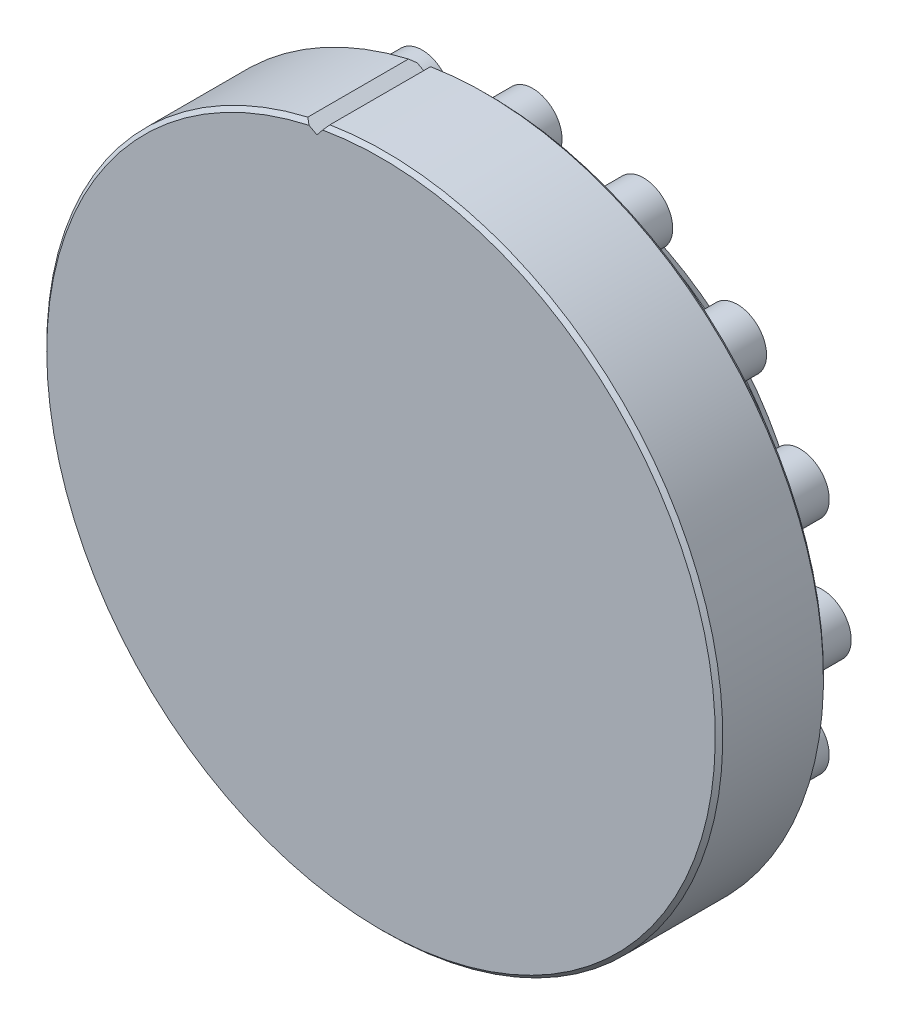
ISO-10303-21;
HEADER;
FILE_DESCRIPTION(('STEP AP214'),'2;1');
FILE_NAME('part.step','',(''),(''),'','','');
FILE_SCHEMA(('AUTOMOTIVE_DESIGN { 1 0 10303 214 1 1 1 1 }'));
ENDSEC;
DATA;
#1=APPLICATION_CONTEXT('core data for automotive mechanical design processes');
#2=APPLICATION_PROTOCOL_DEFINITION('international standard','automotive_design',2000,#1);
#3=PRODUCT_CONTEXT('',#1,'mechanical');
#4=PRODUCT('Part','Part','',(#3));
#5=PRODUCT_RELATED_PRODUCT_CATEGORY('part','',(#4));
#6=PRODUCT_DEFINITION_FORMATION('','',#4);
#7=PRODUCT_DEFINITION_CONTEXT('part definition',#1,'design');
#8=PRODUCT_DEFINITION('design','',#6,#7);
#9=PRODUCT_DEFINITION_SHAPE('','',#8);
#10=(LENGTH_UNIT() NAMED_UNIT(*) SI_UNIT(.MILLI.,.METRE.));
#11=(NAMED_UNIT(*) PLANE_ANGLE_UNIT() SI_UNIT($,.RADIAN.));
#12=(NAMED_UNIT(*) SI_UNIT($,.STERADIAN.) SOLID_ANGLE_UNIT());
#13=UNCERTAINTY_MEASURE_WITH_UNIT(LENGTH_MEASURE(1.E-05),#10,'distance_accuracy_value','');
#14=(GEOMETRIC_REPRESENTATION_CONTEXT(3) GLOBAL_UNCERTAINTY_ASSIGNED_CONTEXT((#13)) GLOBAL_UNIT_ASSIGNED_CONTEXT((#10,
#11,#12)) REPRESENTATION_CONTEXT('',''));
#15=CARTESIAN_POINT('',(0.,0.,0.));
#16=DIRECTION('',(0.,0.,1.));
#17=DIRECTION('',(1.,0.,0.));
#18=AXIS2_PLACEMENT_3D('',#15,#16,#17);
#19=CARTESIAN_POINT('',(0.,0.,7.));
#20=DIRECTION('',(0.,0.,-1.));
#21=DIRECTION('',(-1.,0.,0.));
#22=AXIS2_PLACEMENT_3D('',#19,#20,#21);
#23=PLANE('',#22);
#24=CARTESIAN_POINT('',(0.,0.,7.));
#25=DIRECTION('',(0.,0.,1.));
#26=DIRECTION('',(1.,0.,0.));
#27=AXIS2_PLACEMENT_3D('',#24,#25,#26);
#28=CIRCLE('',#27,22.);
#29=CARTESIAN_POINT('',(-22.,0.,7.));
#30=VERTEX_POINT('',#29);
#31=CARTESIAN_POINT('',(22.,0.,7.));
#32=VERTEX_POINT('',#31);
#33=EDGE_CURVE('E96',#30,#32,#28,.F.);
#34=ORIENTED_EDGE('',*,*,#33,.T.);
#35=CARTESIAN_POINT('',(0.,0.,7.));
#36=DIRECTION('',(0.,0.,1.));
#37=DIRECTION('',(-1.,0.,0.));
#38=AXIS2_PLACEMENT_3D('',#35,#36,#37);
#39=CIRCLE('',#38,22.);
#40=EDGE_CURVE('E101',#32,#30,#39,.F.);
#41=ORIENTED_EDGE('',*,*,#40,.T.);
#42=EDGE_LOOP('',(#34,#41));
#43=FACE_BOUND('',#42,.T.);
#44=ADVANCED_FACE('F18',(#43),#23,.T.);
#45=CARTESIAN_POINT('',(0.,0.,6.5));
#46=DIRECTION('',(0.,0.,-1.));
#47=DIRECTION('',(-1.,0.,0.));
#48=AXIS2_PLACEMENT_3D('',#45,#46,#47);
#49=TOROIDAL_SURFACE('',#48,22.,0.5);
#50=CARTESIAN_POINT('',(0.,0.,6.5));
#51=DIRECTION('',(0.,0.,-1.));
#52=DIRECTION('',(-1.,0.,0.));
#53=AXIS2_PLACEMENT_3D('',#50,#51,#52);
#54=CIRCLE('',#53,22.5);
#55=CARTESIAN_POINT('',(-22.5,0.,6.5));
#56=VERTEX_POINT('',#55);
#57=EDGE_CURVE('E106',#56,#56,#54,.T.);
#58=ORIENTED_EDGE('',*,*,#57,.T.);
#59=EDGE_LOOP('',(#58));
#60=FACE_BOUND('',#59,.T.);
#61=ORIENTED_EDGE('',*,*,#40,.F.);
#62=ORIENTED_EDGE('',*,*,#33,.F.);
#63=EDGE_LOOP('',(#61,#62));
#64=FACE_BOUND('',#63,.T.);
#65=ADVANCED_FACE('F100',(#60,#64),#49,.F.);
#66=CARTESIAN_POINT('',(18.6115367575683,24.1126187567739,12.));
#67=DIRECTION('',(0.,0.,1.));
#68=DIRECTION('',(1.,0.,0.));
#69=AXIS2_PLACEMENT_3D('',#66,#67,#68);
#70=PLANE('',#69);
#71=CARTESIAN_POINT('',(16.1115367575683,24.1126187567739,12.));
#72=DIRECTION('',(0.,0.,-1.));
#73=DIRECTION('',(-1.,0.,0.));
#74=AXIS2_PLACEMENT_3D('',#71,#72,#73);
#75=CIRCLE('',#74,3.);
#76=CARTESIAN_POINT('',(13.1115367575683,24.1126187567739,12.));
#77=VERTEX_POINT('',#76);
#78=EDGE_CURVE('E136',#77,#77,#75,.T.);
#79=ORIENTED_EDGE('',*,*,#78,.T.);
#80=EDGE_LOOP('',(#79));
#81=FACE_BOUND('',#80,.T.);
#82=ADVANCED_FACE('F126',(#81),#70,.F.);
#83=CARTESIAN_POINT('',(-13.6115367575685,-24.1126187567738,12.));
#84=DIRECTION('',(0.,0.,1.));
#85=DIRECTION('',(1.,0.,0.));
#86=AXIS2_PLACEMENT_3D('',#83,#84,#85);
#87=PLANE('',#86);
#88=CARTESIAN_POINT('',(-16.1115367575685,-24.1126187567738,12.));
#89=DIRECTION('',(0.,0.,-1.));
#90=DIRECTION('',(-1.,0.,0.));
#91=AXIS2_PLACEMENT_3D('',#88,#89,#90);
#92=CIRCLE('',#91,3.);
#93=CARTESIAN_POINT('',(-19.1115367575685,-24.1126187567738,12.));
#94=VERTEX_POINT('',#93);
#95=EDGE_CURVE('E139',#94,#94,#92,.T.);
#96=ORIENTED_EDGE('',*,*,#95,.T.);
#97=EDGE_LOOP('',(#96));
#98=FACE_BOUND('',#97,.T.);
#99=ADVANCED_FACE('F1810',(#98),#87,.F.);
#100=CARTESIAN_POINT('',(-3.15761933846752,28.4427731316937,12.));
#101=DIRECTION('',(0.,0.,1.));
#102=DIRECTION('',(1.,0.,0.));
#103=AXIS2_PLACEMENT_3D('',#100,#101,#102);
#104=PLANE('',#103);
#105=CARTESIAN_POINT('',(-5.65761933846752,28.4427731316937,12.));
#106=DIRECTION('',(0.,0.,-1.));
#107=DIRECTION('',(-1.,0.,0.));
#108=AXIS2_PLACEMENT_3D('',#105,#106,#107);
#109=CIRCLE('',#108,3.);
#110=CARTESIAN_POINT('',(-8.65761933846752,28.4427731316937,12.));
#111=VERTEX_POINT('',#110);
#112=EDGE_CURVE('E144',#111,#111,#109,.T.);
#113=ORIENTED_EDGE('',*,*,#112,.T.);
#114=EDGE_LOOP('',(#113));
#115=FACE_BOUND('',#114,.T.);
#116=ADVANCED_FACE('F355',(#115),#104,.F.);
#117=CARTESIAN_POINT('',(-13.6115367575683,24.112618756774,12.));
#118=DIRECTION('',(0.,0.,1.));
#119=DIRECTION('',(1.,0.,0.));
#120=AXIS2_PLACEMENT_3D('',#117,#118,#119);
#121=PLANE('',#120);
#122=CARTESIAN_POINT('',(-16.1115367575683,24.112618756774,12.));
#123=DIRECTION('',(0.,0.,-1.));
#124=DIRECTION('',(-1.,0.,0.));
#125=AXIS2_PLACEMENT_3D('',#122,#123,#124);
#126=CIRCLE('',#125,3.);
#127=CARTESIAN_POINT('',(-19.1115367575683,24.112618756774,12.));
#128=VERTEX_POINT('',#127);
#129=EDGE_CURVE('E350',#128,#128,#126,.T.);
#130=ORIENTED_EDGE('',*,*,#129,.T.);
#131=EDGE_LOOP('',(#130));
#132=FACE_BOUND('',#131,.T.);
#133=ADVANCED_FACE('F1791',(#132),#121,.F.);
#134=CARTESIAN_POINT('',(-21.6126187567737,16.1115367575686,12.));
#135=DIRECTION('',(0.,0.,1.));
#136=DIRECTION('',(1.,0.,0.));
#137=AXIS2_PLACEMENT_3D('',#134,#135,#136);
#138=PLANE('',#137);
#139=CARTESIAN_POINT('',(-24.1126187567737,16.1115367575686,12.));
#140=DIRECTION('',(0.,0.,-1.));
#141=DIRECTION('',(-1.,0.,0.));
#142=AXIS2_PLACEMENT_3D('',#139,#140,#141);
#143=CIRCLE('',#142,3.);
#144=CARTESIAN_POINT('',(-27.1126187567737,16.1115367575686,12.));
#145=VERTEX_POINT('',#144);
#146=EDGE_CURVE('E347',#145,#145,#143,.T.);
#147=ORIENTED_EDGE('',*,*,#146,.T.);
#148=EDGE_LOOP('',(#147));
#149=FACE_BOUND('',#148,.T.);
#150=ADVANCED_FACE('F1781',(#149),#138,.F.);
#151=CARTESIAN_POINT('',(-25.9427731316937,5.65761933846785,12.));
#152=DIRECTION('',(0.,0.,1.));
#153=DIRECTION('',(1.,0.,0.));
#154=AXIS2_PLACEMENT_3D('',#151,#152,#153);
#155=PLANE('',#154);
#156=CARTESIAN_POINT('',(-28.4427731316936,5.65761933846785,12.));
#157=DIRECTION('',(0.,0.,-1.));
#158=DIRECTION('',(-1.,0.,0.));
#159=AXIS2_PLACEMENT_3D('',#156,#157,#158);
#160=CIRCLE('',#159,3.);
#161=CARTESIAN_POINT('',(-31.4427731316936,5.65761933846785,12.));
#162=VERTEX_POINT('',#161);
#163=EDGE_CURVE('E344',#162,#162,#160,.T.);
#164=ORIENTED_EDGE('',*,*,#163,.T.);
#165=EDGE_LOOP('',(#164));
#166=FACE_BOUND('',#165,.T.);
#167=ADVANCED_FACE('F1771',(#166),#155,.F.);
#168=CARTESIAN_POINT('',(-25.9427731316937,-5.65761933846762,12.));
#169=DIRECTION('',(0.,0.,1.));
#170=DIRECTION('',(1.,0.,0.));
#171=AXIS2_PLACEMENT_3D('',#168,#169,#170);
#172=PLANE('',#171);
#173=CARTESIAN_POINT('',(-28.4427731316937,-5.65761933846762,12.));
#174=DIRECTION('',(0.,0.,-1.));
#175=DIRECTION('',(-1.,0.,0.));
#176=AXIS2_PLACEMENT_3D('',#173,#174,#175);
#177=CIRCLE('',#176,3.);
#178=CARTESIAN_POINT('',(-31.4427731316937,-5.65761933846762,12.));
#179=VERTEX_POINT('',#178);
#180=EDGE_CURVE('E341',#179,#179,#177,.T.);
#181=ORIENTED_EDGE('',*,*,#180,.T.);
#182=EDGE_LOOP('',(#181));
#183=FACE_BOUND('',#182,.T.);
#184=ADVANCED_FACE('F1761',(#183),#172,.F.);
#185=CARTESIAN_POINT('',(-21.6126187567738,-16.1115367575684,12.));
#186=DIRECTION('',(0.,0.,1.));
#187=DIRECTION('',(1.,0.,0.));
#188=AXIS2_PLACEMENT_3D('',#185,#186,#187);
#189=PLANE('',#188);
#190=CARTESIAN_POINT('',(-24.1126187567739,-16.1115367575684,12.));
#191=DIRECTION('',(0.,0.,-1.));
#192=DIRECTION('',(-1.,0.,0.));
#193=AXIS2_PLACEMENT_3D('',#190,#191,#192);
#194=CIRCLE('',#193,3.);
#195=CARTESIAN_POINT('',(-27.1126187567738,-16.1115367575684,12.));
#196=VERTEX_POINT('',#195);
#197=EDGE_CURVE('E338',#196,#196,#194,.T.);
#198=ORIENTED_EDGE('',*,*,#197,.T.);
#199=EDGE_LOOP('',(#198));
#200=FACE_BOUND('',#199,.T.);
#201=ADVANCED_FACE('F1751',(#200),#189,.F.);
#202=CARTESIAN_POINT('',(-3.15761933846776,-28.4427731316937,12.));
#203=DIRECTION('',(0.,0.,1.));
#204=DIRECTION('',(1.,0.,0.));
#205=AXIS2_PLACEMENT_3D('',#202,#203,#204);
#206=PLANE('',#205);
#207=CARTESIAN_POINT('',(-5.65761933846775,-28.4427731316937,12.));
#208=DIRECTION('',(0.,0.,-1.));
#209=DIRECTION('',(-1.,0.,0.));
#210=AXIS2_PLACEMENT_3D('',#207,#208,#209);
#211=CIRCLE('',#210,3.);
#212=CARTESIAN_POINT('',(-8.65761933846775,-28.4427731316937,12.));
#213=VERTEX_POINT('',#212);
#214=EDGE_CURVE('E335',#213,#213,#211,.T.);
#215=ORIENTED_EDGE('',*,*,#214,.T.);
#216=EDGE_LOOP('',(#215));
#217=FACE_BOUND('',#216,.T.);
#218=ADVANCED_FACE('F1741',(#217),#206,.F.);
#219=CARTESIAN_POINT('',(8.15761933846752,-28.4427731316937,12.));
#220=DIRECTION('',(0.,0.,1.));
#221=DIRECTION('',(1.,0.,0.));
#222=AXIS2_PLACEMENT_3D('',#219,#220,#221);
#223=PLANE('',#222);
#224=CARTESIAN_POINT('',(5.65761933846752,-28.4427731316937,12.));
#225=DIRECTION('',(0.,0.,-1.));
#226=DIRECTION('',(-1.,0.,0.));
#227=AXIS2_PLACEMENT_3D('',#224,#225,#226);
#228=CIRCLE('',#227,3.);
#229=CARTESIAN_POINT('',(2.65761933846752,-28.4427731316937,12.));
#230=VERTEX_POINT('',#229);
#231=EDGE_CURVE('E332',#230,#230,#228,.T.);
#232=ORIENTED_EDGE('',*,*,#231,.T.);
#233=EDGE_LOOP('',(#232));
#234=FACE_BOUND('',#233,.T.);
#235=ADVANCED_FACE('F1731',(#234),#223,.F.);
#236=CARTESIAN_POINT('',(18.6115367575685,-24.1126187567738,12.));
#237=DIRECTION('',(0.,0.,1.));
#238=DIRECTION('',(1.,0.,0.));
#239=AXIS2_PLACEMENT_3D('',#236,#237,#238);
#240=PLANE('',#239);
#241=CARTESIAN_POINT('',(16.1115367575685,-24.1126187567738,12.));
#242=DIRECTION('',(0.,0.,-1.));
#243=DIRECTION('',(-1.,0.,0.));
#244=AXIS2_PLACEMENT_3D('',#241,#242,#243);
#245=CIRCLE('',#244,3.);
#246=CARTESIAN_POINT('',(13.1115367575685,-24.1126187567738,12.));
#247=VERTEX_POINT('',#246);
#248=EDGE_CURVE('E329',#247,#247,#245,.T.);
#249=ORIENTED_EDGE('',*,*,#248,.T.);
#250=EDGE_LOOP('',(#249));
#251=FACE_BOUND('',#250,.T.);
#252=ADVANCED_FACE('F1721',(#251),#240,.F.);
#253=CARTESIAN_POINT('',(26.6126187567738,-16.1115367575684,12.));
#254=DIRECTION('',(0.,0.,1.));
#255=DIRECTION('',(1.,0.,0.));
#256=AXIS2_PLACEMENT_3D('',#253,#254,#255);
#257=PLANE('',#256);
#258=CARTESIAN_POINT('',(24.1126187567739,-16.1115367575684,12.));
#259=DIRECTION('',(0.,0.,-1.));
#260=DIRECTION('',(-1.,0.,0.));
#261=AXIS2_PLACEMENT_3D('',#258,#259,#260);
#262=CIRCLE('',#261,3.);
#263=CARTESIAN_POINT('',(21.1126187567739,-16.1115367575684,12.));
#264=VERTEX_POINT('',#263);
#265=EDGE_CURVE('E326',#264,#264,#262,.T.);
#266=ORIENTED_EDGE('',*,*,#265,.T.);
#267=EDGE_LOOP('',(#266));
#268=FACE_BOUND('',#267,.T.);
#269=ADVANCED_FACE('F1711',(#268),#257,.F.);
#270=CARTESIAN_POINT('',(30.9427731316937,-5.65761933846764,12.));
#271=DIRECTION('',(0.,0.,1.));
#272=DIRECTION('',(1.,0.,0.));
#273=AXIS2_PLACEMENT_3D('',#270,#271,#272);
#274=PLANE('',#273);
#275=CARTESIAN_POINT('',(28.4427731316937,-5.65761933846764,12.));
#276=DIRECTION('',(0.,0.,-1.));
#277=DIRECTION('',(-1.,0.,0.));
#278=AXIS2_PLACEMENT_3D('',#275,#276,#277);
#279=CIRCLE('',#278,3.);
#280=CARTESIAN_POINT('',(25.4427731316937,-5.65761933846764,12.));
#281=VERTEX_POINT('',#280);
#282=EDGE_CURVE('E323',#281,#281,#279,.T.);
#283=ORIENTED_EDGE('',*,*,#282,.T.);
#284=EDGE_LOOP('',(#283));
#285=FACE_BOUND('',#284,.T.);
#286=ADVANCED_FACE('F1701',(#285),#274,.F.);
#287=CARTESIAN_POINT('',(30.9427731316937,5.65761933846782,12.));
#288=DIRECTION('',(0.,0.,1.));
#289=DIRECTION('',(1.,0.,0.));
#290=AXIS2_PLACEMENT_3D('',#287,#288,#289);
#291=PLANE('',#290);
#292=CARTESIAN_POINT('',(28.4427731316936,5.65761933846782,12.));
#293=DIRECTION('',(0.,0.,-1.));
#294=DIRECTION('',(-1.,0.,0.));
#295=AXIS2_PLACEMENT_3D('',#292,#293,#294);
#296=CIRCLE('',#295,3.);
#297=CARTESIAN_POINT('',(25.4427731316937,5.65761933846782,12.));
#298=VERTEX_POINT('',#297);
#299=EDGE_CURVE('E317',#298,#298,#296,.T.);
#300=ORIENTED_EDGE('',*,*,#299,.T.);
#301=EDGE_LOOP('',(#300));
#302=FACE_BOUND('',#301,.T.);
#303=ADVANCED_FACE('F1691',(#302),#291,.F.);
#304=CARTESIAN_POINT('',(26.6126187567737,16.1115367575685,12.));
#305=DIRECTION('',(0.,0.,1.));
#306=DIRECTION('',(1.,0.,0.));
#307=AXIS2_PLACEMENT_3D('',#304,#305,#306);
#308=PLANE('',#307);
#309=CARTESIAN_POINT('',(24.1126187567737,16.1115367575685,12.));
#310=DIRECTION('',(0.,0.,-1.));
#311=DIRECTION('',(-1.,0.,0.));
#312=AXIS2_PLACEMENT_3D('',#309,#310,#311);
#313=CIRCLE('',#312,3.);
#314=CARTESIAN_POINT('',(21.1126187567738,16.1115367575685,12.));
#315=VERTEX_POINT('',#314);
#316=EDGE_CURVE('E312',#315,#315,#313,.T.);
#317=ORIENTED_EDGE('',*,*,#316,.T.);
#318=EDGE_LOOP('',(#317));
#319=FACE_BOUND('',#318,.T.);
#320=ADVANCED_FACE('F1682',(#319),#308,.F.);
#321=CARTESIAN_POINT('',(8.15761933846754,28.4427731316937,12.));
#322=DIRECTION('',(0.,0.,1.));
#323=DIRECTION('',(1.,0.,0.));
#324=AXIS2_PLACEMENT_3D('',#321,#322,#323);
#325=PLANE('',#324);
#326=CARTESIAN_POINT('',(5.65761933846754,28.4427731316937,12.));
#327=DIRECTION('',(0.,0.,-1.));
#328=DIRECTION('',(-1.,0.,0.));
#329=AXIS2_PLACEMENT_3D('',#326,#327,#328);
#330=CIRCLE('',#329,3.);
#331=CARTESIAN_POINT('',(2.65761933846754,28.4427731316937,12.));
#332=VERTEX_POINT('',#331);
#333=EDGE_CURVE('E308',#332,#332,#330,.T.);
#334=ORIENTED_EDGE('',*,*,#333,.T.);
#335=EDGE_LOOP('',(#334));
#336=FACE_BOUND('',#335,.T.);
#337=ADVANCED_FACE('F1672',(#336),#325,.F.);
#338=CARTESIAN_POINT('',(-1.84964890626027E-13,26.5,9.99999999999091));
#339=DIRECTION('',(0.,0.,-1.));
#340=DIRECTION('',(-1.,0.,0.));
#341=AXIS2_PLACEMENT_3D('',#338,#339,#340);
#342=CONICAL_SURFACE('',#341,2.00000000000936,1.02974425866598);
#343=CARTESIAN_POINT('',(0.,26.5,11.2017212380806));
#344=VERTEX_POINT('',#343);
#345=VERTEX_LOOP('',#344);
#346=FACE_BOUND('',#345,.T.);
#347=CARTESIAN_POINT('',(-1.85048510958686E-13,26.5,10.));
#348=DIRECTION('',(0.,0.,-1.));
#349=DIRECTION('',(-1.,0.,0.));
#350=AXIS2_PLACEMENT_3D('',#347,#348,#349);
#351=CIRCLE('',#350,2.);
#352=CARTESIAN_POINT('',(-2.00000000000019,26.5,10.));
#353=VERTEX_POINT('',#352);
#354=EDGE_CURVE('E133',#353,#353,#351,.T.);
#355=ORIENTED_EDGE('',*,*,#354,.T.);
#356=EDGE_LOOP('',(#355));
#357=FACE_BOUND('',#356,.T.);
#358=ADVANCED_FACE('F1663',(#346,#357),#342,.F.);
#359=CARTESIAN_POINT('',(0.,0.,7.));
#360=DIRECTION('',(0.,0.,-1.));
#361=DIRECTION('',(-1.,0.,0.));
#362=AXIS2_PLACEMENT_3D('',#359,#360,#361);
#363=CYLINDRICAL_SURFACE('',#362,22.5);
#364=CARTESIAN_POINT('',(0.,0.,0.999999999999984));
#365=DIRECTION('',(0.,0.,-1.));
#366=DIRECTION('',(-1.,0.,0.));
#367=AXIS2_PLACEMENT_3D('',#364,#365,#366);
#368=CIRCLE('',#367,22.5);
#369=CARTESIAN_POINT('',(-22.5,0.,0.999999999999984));
#370=VERTEX_POINT('',#369);
#371=EDGE_CURVE('E299',#370,#370,#368,.T.);
#372=ORIENTED_EDGE('',*,*,#371,.T.);
#373=EDGE_LOOP('',(#372));
#374=FACE_BOUND('',#373,.T.);
#375=ORIENTED_EDGE('',*,*,#57,.F.);
#376=EDGE_LOOP('',(#375));
#377=FACE_BOUND('',#376,.T.);
#378=ADVANCED_FACE('F1653',(#374,#377),#363,.F.);
#379=CARTESIAN_POINT('',(16.1115367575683,24.1126187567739,0.));
#380=DIRECTION('',(0.,0.,-1.));
#381=DIRECTION('',(-1.,0.,0.));
#382=AXIS2_PLACEMENT_3D('',#379,#380,#381);
#383=CYLINDRICAL_SURFACE('',#382,3.);
#384=ORIENTED_EDGE('',*,*,#78,.F.);
#385=EDGE_LOOP('',(#384));
#386=FACE_BOUND('',#385,.T.);
#387=CARTESIAN_POINT('',(16.1115367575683,24.1126187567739,0.));
#388=DIRECTION('',(0.,0.,-1.));
#389=DIRECTION('',(-1.,0.,0.));
#390=AXIS2_PLACEMENT_3D('',#387,#388,#389);
#391=CIRCLE('',#390,3.);
#392=CARTESIAN_POINT('',(13.1115367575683,24.1126187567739,0.));
#393=VERTEX_POINT('',#392);
#394=EDGE_CURVE('E301',#393,#393,#391,.T.);
#395=ORIENTED_EDGE('',*,*,#394,.T.);
#396=EDGE_LOOP('',(#395));
#397=FACE_BOUND('',#396,.T.);
#398=ADVANCED_FACE('F1643',(#386,#397),#383,.F.);
#399=CARTESIAN_POINT('',(-16.1115367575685,-24.1126187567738,0.));
#400=DIRECTION('',(0.,0.,-1.));
#401=DIRECTION('',(-1.,0.,0.));
#402=AXIS2_PLACEMENT_3D('',#399,#400,#401);
#403=CYLINDRICAL_SURFACE('',#402,3.);
#404=ORIENTED_EDGE('',*,*,#95,.F.);
#405=EDGE_LOOP('',(#404));
#406=FACE_BOUND('',#405,.T.);
#407=CARTESIAN_POINT('',(-16.1115367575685,-24.1126187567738,0.));
#408=DIRECTION('',(0.,0.,-1.));
#409=DIRECTION('',(-1.,0.,0.));
#410=AXIS2_PLACEMENT_3D('',#407,#408,#409);
#411=CIRCLE('',#410,3.);
#412=CARTESIAN_POINT('',(-19.1115367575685,-24.1126187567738,0.));
#413=VERTEX_POINT('',#412);
#414=EDGE_CURVE('E305',#413,#413,#411,.T.);
#415=ORIENTED_EDGE('',*,*,#414,.T.);
#416=EDGE_LOOP('',(#415));
#417=FACE_BOUND('',#416,.T.);
#418=ADVANCED_FACE('F361',(#406,#417),#403,.F.);
#419=CARTESIAN_POINT('',(-5.65761933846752,28.4427731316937,0.));
#420=DIRECTION('',(0.,0.,-1.));
#421=DIRECTION('',(-1.,0.,0.));
#422=AXIS2_PLACEMENT_3D('',#419,#420,#421);
#423=CYLINDRICAL_SURFACE('',#422,3.);
#424=ORIENTED_EDGE('',*,*,#112,.F.);
#425=EDGE_LOOP('',(#424));
#426=FACE_BOUND('',#425,.T.);
#427=CARTESIAN_POINT('',(-5.65761933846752,28.4427731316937,0.));
#428=DIRECTION('',(0.,0.,-1.));
#429=DIRECTION('',(-1.,0.,0.));
#430=AXIS2_PLACEMENT_3D('',#427,#428,#429);
#431=CIRCLE('',#430,3.);
#432=CARTESIAN_POINT('',(-8.65761933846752,28.4427731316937,0.));
#433=VERTEX_POINT('',#432);
#434=EDGE_CURVE('E365',#433,#433,#431,.T.);
#435=ORIENTED_EDGE('',*,*,#434,.T.);
#436=EDGE_LOOP('',(#435));
#437=FACE_BOUND('',#436,.T.);
#438=ADVANCED_FACE('F357',(#426,#437),#423,.F.);
#439=CARTESIAN_POINT('',(-16.1115367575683,24.112618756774,0.));
#440=DIRECTION('',(0.,0.,-1.));
#441=DIRECTION('',(-1.,0.,0.));
#442=AXIS2_PLACEMENT_3D('',#439,#440,#441);
#443=CYLINDRICAL_SURFACE('',#442,3.);
#444=ORIENTED_EDGE('',*,*,#129,.F.);
#445=EDGE_LOOP('',(#444));
#446=FACE_BOUND('',#445,.T.);
#447=CARTESIAN_POINT('',(-16.1115367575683,24.112618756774,0.));
#448=DIRECTION('',(0.,0.,-1.));
#449=DIRECTION('',(-1.,0.,0.));
#450=AXIS2_PLACEMENT_3D('',#447,#448,#449);
#451=CIRCLE('',#450,3.);
#452=CARTESIAN_POINT('',(-19.1115367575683,24.112618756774,0.));
#453=VERTEX_POINT('',#452);
#454=EDGE_CURVE('E367',#453,#453,#451,.T.);
#455=ORIENTED_EDGE('',*,*,#454,.T.);
#456=EDGE_LOOP('',(#455));
#457=FACE_BOUND('',#456,.T.);
#458=ADVANCED_FACE('F360',(#446,#457),#443,.F.);
#459=CARTESIAN_POINT('',(-24.1126187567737,16.1115367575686,0.));
#460=DIRECTION('',(0.,0.,-1.));
#461=DIRECTION('',(-1.,0.,0.));
#462=AXIS2_PLACEMENT_3D('',#459,#460,#461);
#463=CYLINDRICAL_SURFACE('',#462,3.);
#464=ORIENTED_EDGE('',*,*,#146,.F.);
#465=EDGE_LOOP('',(#464));
#466=FACE_BOUND('',#465,.T.);
#467=CARTESIAN_POINT('',(-24.1126187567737,16.1115367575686,0.));
#468=DIRECTION('',(0.,0.,-1.));
#469=DIRECTION('',(-1.,0.,0.));
#470=AXIS2_PLACEMENT_3D('',#467,#468,#469);
#471=CIRCLE('',#470,3.);
#472=CARTESIAN_POINT('',(-27.1126187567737,16.1115367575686,0.));
#473=VERTEX_POINT('',#472);
#474=EDGE_CURVE('E370',#473,#473,#471,.T.);
#475=ORIENTED_EDGE('',*,*,#474,.T.);
#476=EDGE_LOOP('',(#475));
#477=FACE_BOUND('',#476,.T.);
#478=ADVANCED_FACE('F1609',(#466,#477),#463,.F.);
#479=CARTESIAN_POINT('',(-28.4427731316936,5.65761933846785,0.));
#480=DIRECTION('',(0.,0.,-1.));
#481=DIRECTION('',(-1.,0.,0.));
#482=AXIS2_PLACEMENT_3D('',#479,#480,#481);
#483=CYLINDRICAL_SURFACE('',#482,3.);
#484=ORIENTED_EDGE('',*,*,#163,.F.);
#485=EDGE_LOOP('',(#484));
#486=FACE_BOUND('',#485,.T.);
#487=CARTESIAN_POINT('',(-28.4427731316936,5.65761933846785,0.));
#488=DIRECTION('',(0.,0.,-1.));
#489=DIRECTION('',(-1.,0.,0.));
#490=AXIS2_PLACEMENT_3D('',#487,#488,#489);
#491=CIRCLE('',#490,3.);
#492=CARTESIAN_POINT('',(-31.4427731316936,5.65761933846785,0.));
#493=VERTEX_POINT('',#492);
#494=EDGE_CURVE('E376',#493,#493,#491,.T.);
#495=ORIENTED_EDGE('',*,*,#494,.T.);
#496=EDGE_LOOP('',(#495));
#497=FACE_BOUND('',#496,.T.);
#498=ADVANCED_FACE('F1599',(#486,#497),#483,.F.);
#499=CARTESIAN_POINT('',(-28.4427731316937,-5.65761933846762,0.));
#500=DIRECTION('',(0.,0.,-1.));
#501=DIRECTION('',(-1.,0.,0.));
#502=AXIS2_PLACEMENT_3D('',#499,#500,#501);
#503=CYLINDRICAL_SURFACE('',#502,3.);
#504=ORIENTED_EDGE('',*,*,#180,.F.);
#505=EDGE_LOOP('',(#504));
#506=FACE_BOUND('',#505,.T.);
#507=CARTESIAN_POINT('',(-28.4427731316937,-5.65761933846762,0.));
#508=DIRECTION('',(0.,0.,-1.));
#509=DIRECTION('',(-1.,0.,0.));
#510=AXIS2_PLACEMENT_3D('',#507,#508,#509);
#511=CIRCLE('',#510,3.);
#512=CARTESIAN_POINT('',(-31.4427731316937,-5.65761933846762,0.));
#513=VERTEX_POINT('',#512);
#514=EDGE_CURVE('E379',#513,#513,#511,.T.);
#515=ORIENTED_EDGE('',*,*,#514,.T.);
#516=EDGE_LOOP('',(#515));
#517=FACE_BOUND('',#516,.T.);
#518=ADVANCED_FACE('F1589',(#506,#517),#503,.F.);
#519=CARTESIAN_POINT('',(-24.1126187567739,-16.1115367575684,0.));
#520=DIRECTION('',(0.,0.,-1.));
#521=DIRECTION('',(-1.,0.,0.));
#522=AXIS2_PLACEMENT_3D('',#519,#520,#521);
#523=CYLINDRICAL_SURFACE('',#522,3.);
#524=ORIENTED_EDGE('',*,*,#197,.F.);
#525=EDGE_LOOP('',(#524));
#526=FACE_BOUND('',#525,.T.);
#527=CARTESIAN_POINT('',(-24.1126187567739,-16.1115367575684,0.));
#528=DIRECTION('',(0.,0.,-1.));
#529=DIRECTION('',(-1.,0.,0.));
#530=AXIS2_PLACEMENT_3D('',#527,#528,#529);
#531=CIRCLE('',#530,3.);
#532=CARTESIAN_POINT('',(-27.1126187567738,-16.1115367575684,0.));
#533=VERTEX_POINT('',#532);
#534=EDGE_CURVE('E382',#533,#533,#531,.T.);
#535=ORIENTED_EDGE('',*,*,#534,.T.);
#536=EDGE_LOOP('',(#535));
#537=FACE_BOUND('',#536,.T.);
#538=ADVANCED_FACE('F1579',(#526,#537),#523,.F.);
#539=CARTESIAN_POINT('',(-5.65761933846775,-28.4427731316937,0.));
#540=DIRECTION('',(0.,0.,-1.));
#541=DIRECTION('',(-1.,0.,0.));
#542=AXIS2_PLACEMENT_3D('',#539,#540,#541);
#543=CYLINDRICAL_SURFACE('',#542,3.);
#544=ORIENTED_EDGE('',*,*,#214,.F.);
#545=EDGE_LOOP('',(#544));
#546=FACE_BOUND('',#545,.T.);
#547=CARTESIAN_POINT('',(-5.65761933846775,-28.4427731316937,0.));
#548=DIRECTION('',(0.,0.,-1.));
#549=DIRECTION('',(-1.,0.,0.));
#550=AXIS2_PLACEMENT_3D('',#547,#548,#549);
#551=CIRCLE('',#550,3.);
#552=CARTESIAN_POINT('',(-8.65761933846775,-28.4427731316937,0.));
#553=VERTEX_POINT('',#552);
#554=EDGE_CURVE('E385',#553,#553,#551,.T.);
#555=ORIENTED_EDGE('',*,*,#554,.T.);
#556=EDGE_LOOP('',(#555));
#557=FACE_BOUND('',#556,.T.);
#558=ADVANCED_FACE('F1569',(#546,#557),#543,.F.);
#559=CARTESIAN_POINT('',(5.65761933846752,-28.4427731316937,0.));
#560=DIRECTION('',(0.,0.,-1.));
#561=DIRECTION('',(-1.,0.,0.));
#562=AXIS2_PLACEMENT_3D('',#559,#560,#561);
#563=CYLINDRICAL_SURFACE('',#562,3.);
#564=ORIENTED_EDGE('',*,*,#231,.F.);
#565=EDGE_LOOP('',(#564));
#566=FACE_BOUND('',#565,.T.);
#567=CARTESIAN_POINT('',(5.65761933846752,-28.4427731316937,0.));
#568=DIRECTION('',(0.,0.,-1.));
#569=DIRECTION('',(-1.,0.,0.));
#570=AXIS2_PLACEMENT_3D('',#567,#568,#569);
#571=CIRCLE('',#570,3.);
#572=CARTESIAN_POINT('',(2.65761933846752,-28.4427731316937,0.));
#573=VERTEX_POINT('',#572);
#574=EDGE_CURVE('E388',#573,#573,#571,.T.);
#575=ORIENTED_EDGE('',*,*,#574,.T.);
#576=EDGE_LOOP('',(#575));
#577=FACE_BOUND('',#576,.T.);
#578=ADVANCED_FACE('F1559',(#566,#577),#563,.F.);
#579=CARTESIAN_POINT('',(16.1115367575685,-24.1126187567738,0.));
#580=DIRECTION('',(0.,0.,-1.));
#581=DIRECTION('',(-1.,0.,0.));
#582=AXIS2_PLACEMENT_3D('',#579,#580,#581);
#583=CYLINDRICAL_SURFACE('',#582,3.);
#584=ORIENTED_EDGE('',*,*,#248,.F.);
#585=EDGE_LOOP('',(#584));
#586=FACE_BOUND('',#585,.T.);
#587=CARTESIAN_POINT('',(16.1115367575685,-24.1126187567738,0.));
#588=DIRECTION('',(0.,0.,-1.));
#589=DIRECTION('',(-1.,0.,0.));
#590=AXIS2_PLACEMENT_3D('',#587,#588,#589);
#591=CIRCLE('',#590,3.);
#592=CARTESIAN_POINT('',(13.1115367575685,-24.1126187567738,0.));
#593=VERTEX_POINT('',#592);
#594=EDGE_CURVE('E391',#593,#593,#591,.T.);
#595=ORIENTED_EDGE('',*,*,#594,.T.);
#596=EDGE_LOOP('',(#595));
#597=FACE_BOUND('',#596,.T.);
#598=ADVANCED_FACE('F1549',(#586,#597),#583,.F.);
#599=CARTESIAN_POINT('',(24.1126187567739,-16.1115367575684,0.));
#600=DIRECTION('',(0.,0.,-1.));
#601=DIRECTION('',(-1.,0.,0.));
#602=AXIS2_PLACEMENT_3D('',#599,#600,#601);
#603=CYLINDRICAL_SURFACE('',#602,3.);
#604=ORIENTED_EDGE('',*,*,#265,.F.);
#605=EDGE_LOOP('',(#604));
#606=FACE_BOUND('',#605,.T.);
#607=CARTESIAN_POINT('',(24.1126187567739,-16.1115367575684,0.));
#608=DIRECTION('',(0.,0.,-1.));
#609=DIRECTION('',(-1.,0.,0.));
#610=AXIS2_PLACEMENT_3D('',#607,#608,#609);
#611=CIRCLE('',#610,3.);
#612=CARTESIAN_POINT('',(21.1126187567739,-16.1115367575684,0.));
#613=VERTEX_POINT('',#612);
#614=EDGE_CURVE('E394',#613,#613,#611,.T.);
#615=ORIENTED_EDGE('',*,*,#614,.T.);
#616=EDGE_LOOP('',(#615));
#617=FACE_BOUND('',#616,.T.);
#618=ADVANCED_FACE('F1539',(#606,#617),#603,.F.);
#619=CARTESIAN_POINT('',(28.4427731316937,-5.65761933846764,0.));
#620=DIRECTION('',(0.,0.,-1.));
#621=DIRECTION('',(-1.,0.,0.));
#622=AXIS2_PLACEMENT_3D('',#619,#620,#621);
#623=CYLINDRICAL_SURFACE('',#622,3.);
#624=ORIENTED_EDGE('',*,*,#282,.F.);
#625=EDGE_LOOP('',(#624));
#626=FACE_BOUND('',#625,.T.);
#627=CARTESIAN_POINT('',(28.4427731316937,-5.65761933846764,0.));
#628=DIRECTION('',(0.,0.,-1.));
#629=DIRECTION('',(-1.,0.,0.));
#630=AXIS2_PLACEMENT_3D('',#627,#628,#629);
#631=CIRCLE('',#630,3.);
#632=CARTESIAN_POINT('',(25.4427731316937,-5.65761933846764,0.));
#633=VERTEX_POINT('',#632);
#634=EDGE_CURVE('E397',#633,#633,#631,.T.);
#635=ORIENTED_EDGE('',*,*,#634,.T.);
#636=EDGE_LOOP('',(#635));
#637=FACE_BOUND('',#636,.T.);
#638=ADVANCED_FACE('F1529',(#626,#637),#623,.F.);
#639=CARTESIAN_POINT('',(28.4427731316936,5.65761933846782,0.));
#640=DIRECTION('',(0.,0.,-1.));
#641=DIRECTION('',(-1.,0.,0.));
#642=AXIS2_PLACEMENT_3D('',#639,#640,#641);
#643=CYLINDRICAL_SURFACE('',#642,3.);
#644=ORIENTED_EDGE('',*,*,#299,.F.);
#645=EDGE_LOOP('',(#644));
#646=FACE_BOUND('',#645,.T.);
#647=CARTESIAN_POINT('',(28.4427731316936,5.65761933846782,0.));
#648=DIRECTION('',(0.,0.,-1.));
#649=DIRECTION('',(-1.,0.,0.));
#650=AXIS2_PLACEMENT_3D('',#647,#648,#649);
#651=CIRCLE('',#650,3.);
#652=CARTESIAN_POINT('',(25.4427731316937,5.65761933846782,0.));
#653=VERTEX_POINT('',#652);
#654=EDGE_CURVE('E400',#653,#653,#651,.T.);
#655=ORIENTED_EDGE('',*,*,#654,.T.);
#656=EDGE_LOOP('',(#655));
#657=FACE_BOUND('',#656,.T.);
#658=ADVANCED_FACE('F1519',(#646,#657),#643,.F.);
#659=CARTESIAN_POINT('',(24.1126187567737,16.1115367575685,0.));
#660=DIRECTION('',(0.,0.,-1.));
#661=DIRECTION('',(-1.,0.,0.));
#662=AXIS2_PLACEMENT_3D('',#659,#660,#661);
#663=CYLINDRICAL_SURFACE('',#662,3.);
#664=ORIENTED_EDGE('',*,*,#316,.F.);
#665=EDGE_LOOP('',(#664));
#666=FACE_BOUND('',#665,.T.);
#667=CARTESIAN_POINT('',(24.1126187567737,16.1115367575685,0.));
#668=DIRECTION('',(0.,0.,-1.));
#669=DIRECTION('',(-1.,0.,0.));
#670=AXIS2_PLACEMENT_3D('',#667,#668,#669);
#671=CIRCLE('',#670,3.);
#672=CARTESIAN_POINT('',(21.1126187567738,16.1115367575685,0.));
#673=VERTEX_POINT('',#672);
#674=EDGE_CURVE('E403',#673,#673,#671,.T.);
#675=ORIENTED_EDGE('',*,*,#674,.T.);
#676=EDGE_LOOP('',(#675));
#677=FACE_BOUND('',#676,.T.);
#678=ADVANCED_FACE('F1509',(#666,#677),#663,.F.);
#679=CARTESIAN_POINT('',(5.65761933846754,28.4427731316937,0.));
#680=DIRECTION('',(0.,0.,-1.));
#681=DIRECTION('',(-1.,0.,0.));
#682=AXIS2_PLACEMENT_3D('',#679,#680,#681);
#683=CYLINDRICAL_SURFACE('',#682,3.);
#684=ORIENTED_EDGE('',*,*,#333,.F.);
#685=EDGE_LOOP('',(#684));
#686=FACE_BOUND('',#685,.T.);
#687=CARTESIAN_POINT('',(5.65761933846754,28.4427731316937,0.));
#688=DIRECTION('',(0.,0.,-1.));
#689=DIRECTION('',(-1.,0.,0.));
#690=AXIS2_PLACEMENT_3D('',#687,#688,#689);
#691=CIRCLE('',#690,3.);
#692=CARTESIAN_POINT('',(2.65761933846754,28.4427731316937,0.));
#693=VERTEX_POINT('',#692);
#694=EDGE_CURVE('E406',#693,#693,#691,.T.);
#695=ORIENTED_EDGE('',*,*,#694,.T.);
#696=EDGE_LOOP('',(#695));
#697=FACE_BOUND('',#696,.T.);
#698=ADVANCED_FACE('F1499',(#686,#697),#683,.F.);
#699=CARTESIAN_POINT('',(-1.85048510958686E-13,26.5,0.));
#700=DIRECTION('',(0.,0.,-1.));
#701=DIRECTION('',(-1.,0.,0.));
#702=AXIS2_PLACEMENT_3D('',#699,#700,#701);
#703=CYLINDRICAL_SURFACE('',#702,2.);
#704=ORIENTED_EDGE('',*,*,#354,.F.);
#705=EDGE_LOOP('',(#704));
#706=FACE_BOUND('',#705,.T.);
#707=CARTESIAN_POINT('',(-1.85048510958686E-13,26.5,0.));
#708=DIRECTION('',(0.,0.,-1.));
#709=DIRECTION('',(-1.,0.,0.));
#710=AXIS2_PLACEMENT_3D('',#707,#708,#709);
#711=CIRCLE('',#710,2.);
#712=CARTESIAN_POINT('',(-2.00000000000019,26.5,0.));
#713=VERTEX_POINT('',#712);
#714=EDGE_CURVE('E409',#713,#713,#711,.T.);
#715=ORIENTED_EDGE('',*,*,#714,.T.);
#716=EDGE_LOOP('',(#715));
#717=FACE_BOUND('',#716,.T.);
#718=ADVANCED_FACE('F1489',(#706,#717),#703,.F.);
#719=CARTESIAN_POINT('',(0.,0.,0.));
#720=DIRECTION('',(0.,0.,-1.));
#721=DIRECTION('',(-1.,0.,0.));
#722=AXIS2_PLACEMENT_3D('',#719,#720,#721);
#723=CONICAL_SURFACE('',#722,23.5,0.785398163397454);
#724=CARTESIAN_POINT('',(0.,0.,0.));
#725=DIRECTION('',(0.,0.,-1.));
#726=DIRECTION('',(-1.,0.,0.));
#727=AXIS2_PLACEMENT_3D('',#724,#725,#726);
#728=CIRCLE('',#727,23.5);
#729=CARTESIAN_POINT('',(-23.5,0.,0.));
#730=VERTEX_POINT('',#729);
#731=EDGE_CURVE('E412',#730,#730,#728,.T.);
#732=ORIENTED_EDGE('',*,*,#731,.T.);
#733=EDGE_LOOP('',(#732));
#734=FACE_BOUND('',#733,.T.);
#735=ORIENTED_EDGE('',*,*,#371,.F.);
#736=EDGE_LOOP('',(#735));
#737=FACE_BOUND('',#736,.T.);
#738=ADVANCED_FACE('F1479',(#734,#737),#723,.F.);
#739=CARTESIAN_POINT('',(0.,0.,0.));
#740=DIRECTION('',(0.,0.,1.));
#741=DIRECTION('',(1.,0.,0.));
#742=AXIS2_PLACEMENT_3D('',#739,#740,#741);
#743=PLANE('',#742);
#744=ORIENTED_EDGE('',*,*,#731,.F.);
#745=EDGE_LOOP('',(#744));
#746=FACE_BOUND('',#745,.T.);
#747=ORIENTED_EDGE('',*,*,#714,.F.);
#748=EDGE_LOOP('',(#747));
#749=FACE_BOUND('',#748,.T.);
#750=ORIENTED_EDGE('',*,*,#694,.F.);
#751=EDGE_LOOP('',(#750));
#752=FACE_BOUND('',#751,.T.);
#753=ORIENTED_EDGE('',*,*,#674,.F.);
#754=EDGE_LOOP('',(#753));
#755=FACE_BOUND('',#754,.T.);
#756=ORIENTED_EDGE('',*,*,#654,.F.);
#757=EDGE_LOOP('',(#756));
#758=FACE_BOUND('',#757,.T.);
#759=ORIENTED_EDGE('',*,*,#634,.F.);
#760=EDGE_LOOP('',(#759));
#761=FACE_BOUND('',#760,.T.);
#762=ORIENTED_EDGE('',*,*,#614,.F.);
#763=EDGE_LOOP('',(#762));
#764=FACE_BOUND('',#763,.T.);
#765=ORIENTED_EDGE('',*,*,#594,.F.);
#766=EDGE_LOOP('',(#765));
#767=FACE_BOUND('',#766,.T.);
#768=ORIENTED_EDGE('',*,*,#574,.F.);
#769=EDGE_LOOP('',(#768));
#770=FACE_BOUND('',#769,.T.);
#771=ORIENTED_EDGE('',*,*,#554,.F.);
#772=EDGE_LOOP('',(#771));
#773=FACE_BOUND('',#772,.T.);
#774=ORIENTED_EDGE('',*,*,#534,.F.);
#775=EDGE_LOOP('',(#774));
#776=FACE_BOUND('',#775,.T.);
#777=ORIENTED_EDGE('',*,*,#514,.F.);
#778=EDGE_LOOP('',(#777));
#779=FACE_BOUND('',#778,.T.);
#780=ORIENTED_EDGE('',*,*,#494,.F.);
#781=EDGE_LOOP('',(#780));
#782=FACE_BOUND('',#781,.T.);
#783=ORIENTED_EDGE('',*,*,#474,.F.);
#784=EDGE_LOOP('',(#783));
#785=FACE_BOUND('',#784,.T.);
#786=ORIENTED_EDGE('',*,*,#454,.F.);
#787=EDGE_LOOP('',(#786));
#788=FACE_BOUND('',#787,.T.);
#789=ORIENTED_EDGE('',*,*,#434,.F.);
#790=EDGE_LOOP('',(#789));
#791=FACE_BOUND('',#790,.T.);
#792=ORIENTED_EDGE('',*,*,#414,.F.);
#793=EDGE_LOOP('',(#792));
#794=FACE_BOUND('',#793,.T.);
#795=ORIENTED_EDGE('',*,*,#394,.F.);
#796=EDGE_LOOP('',(#795));
#797=FACE_BOUND('',#796,.T.);
#798=CARTESIAN_POINT('',(0.,0.,0.));
#799=DIRECTION('',(0.,0.,1.));
#800=DIRECTION('',(0.,-1.,0.));
#801=AXIS2_PLACEMENT_3D('',#798,#799,#800);
#802=CIRCLE('',#801,33.4226497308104);
#803=CARTESIAN_POINT('',(0.,-33.4226497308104,0.));
#804=VERTEX_POINT('',#803);
#805=EDGE_CURVE('E298',#804,#804,#802,.T.);
#806=ORIENTED_EDGE('',*,*,#805,.F.);
#807=EDGE_LOOP('',(#806));
#808=FACE_BOUND('',#807,.T.);
#809=ADVANCED_FACE('F1469',(#746,#749,#752,#755,#758,#761,#764,#767,#770,#773,#776,#779,#782,
#785,#788,#791,#794,#797,#808),#743,.F.);
#810=CARTESIAN_POINT('',(0.,0.,0.999999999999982));
#811=DIRECTION('',(0.,0.,1.));
#812=DIRECTION('',(0.,-1.,0.));
#813=AXIS2_PLACEMENT_3D('',#810,#811,#812);
#814=CONICAL_SURFACE('',#813,34.,0.523598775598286);
#815=CARTESIAN_POINT('',(0.,0.,0.999999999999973));
#816=DIRECTION('',(0.,0.,-1.));
#817=DIRECTION('',(-1.,0.,0.));
#818=AXIS2_PLACEMENT_3D('',#815,#816,#817);
#819=CIRCLE('',#818,34.);
#820=CARTESIAN_POINT('',(-34.,0.,0.999999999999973));
#821=VERTEX_POINT('',#820);
#822=EDGE_CURVE('E290',#821,#821,#819,.F.);
#823=ORIENTED_EDGE('',*,*,#822,.F.);
#824=EDGE_LOOP('',(#823));
#825=FACE_BOUND('',#824,.T.);
#826=ORIENTED_EDGE('',*,*,#805,.T.);
#827=EDGE_LOOP('',(#826));
#828=FACE_BOUND('',#827,.T.);
#829=ADVANCED_FACE('F1459',(#825,#828),#814,.T.);
#830=CARTESIAN_POINT('',(14.7333121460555,35.5693620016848,2.8));
#831=DIRECTION('',(0.,0.,-1.));
#832=DIRECTION('',(-1.,0.,0.));
#833=AXIS2_PLACEMENT_3D('',#830,#831,#832);
#834=PLANE('',#833);
#835=CARTESIAN_POINT('',(14.7333121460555,35.5693620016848,2.8));
#836=DIRECTION('',(0.,0.,1.));
#837=DIRECTION('',(1.,0.,0.));
#838=AXIS2_PLACEMENT_3D('',#835,#836,#837);
#839=CIRCLE('',#838,3.9);
#840=CARTESIAN_POINT('',(18.6333121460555,35.5693620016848,2.8));
#841=VERTEX_POINT('',#840);
#842=EDGE_CURVE('E297',#841,#841,#839,.T.);
#843=ORIENTED_EDGE('',*,*,#842,.F.);
#844=EDGE_LOOP('',(#843));
#845=FACE_BOUND('',#844,.T.);
#846=ADVANCED_FACE('F1449',(#845),#834,.T.);
#847=CARTESIAN_POINT('',(27.2236110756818,27.2236110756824,2.8));
#848=DIRECTION('',(0.,0.,-1.));
#849=DIRECTION('',(-1.,0.,0.));
#850=AXIS2_PLACEMENT_3D('',#847,#848,#849);
#851=PLANE('',#850);
#852=CARTESIAN_POINT('',(27.2236110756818,27.2236110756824,2.8));
#853=DIRECTION('',(0.,0.,1.));
#854=DIRECTION('',(1.,0.,0.));
#855=AXIS2_PLACEMENT_3D('',#852,#853,#854);
#856=CIRCLE('',#855,3.9);
#857=CARTESIAN_POINT('',(31.1236110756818,27.2236110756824,2.8));
#858=VERTEX_POINT('',#857);
#859=EDGE_CURVE('E419',#858,#858,#856,.T.);
#860=ORIENTED_EDGE('',*,*,#859,.F.);
#861=EDGE_LOOP('',(#860));
#862=FACE_BOUND('',#861,.T.);
#863=ADVANCED_FACE('F1439',(#862),#851,.T.);
#864=CARTESIAN_POINT('',(35.5693620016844,14.7333121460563,2.8));
#865=DIRECTION('',(0.,0.,-1.));
#866=DIRECTION('',(-1.,0.,0.));
#867=AXIS2_PLACEMENT_3D('',#864,#865,#866);
#868=PLANE('',#867);
#869=CARTESIAN_POINT('',(35.5693620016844,14.7333121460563,2.8));
#870=DIRECTION('',(0.,0.,1.));
#871=DIRECTION('',(1.,0.,0.));
#872=AXIS2_PLACEMENT_3D('',#869,#870,#871);
#873=CIRCLE('',#872,3.9);
#874=CARTESIAN_POINT('',(39.4693620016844,14.7333121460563,2.8));
#875=VERTEX_POINT('',#874);
#876=EDGE_CURVE('E422',#875,#875,#873,.T.);
#877=ORIENTED_EDGE('',*,*,#876,.F.);
#878=EDGE_LOOP('',(#877));
#879=FACE_BOUND('',#878,.T.);
#880=ADVANCED_FACE('F1429',(#879),#868,.T.);
#881=CARTESIAN_POINT('',(38.5,4.03266094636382E-13,2.8));
#882=DIRECTION('',(0.,0.,-1.));
#883=DIRECTION('',(-1.,0.,0.));
#884=AXIS2_PLACEMENT_3D('',#881,#882,#883);
#885=PLANE('',#884);
#886=CARTESIAN_POINT('',(38.5,4.03266094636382E-13,2.8));
#887=DIRECTION('',(0.,0.,1.));
#888=DIRECTION('',(1.,0.,0.));
#889=AXIS2_PLACEMENT_3D('',#886,#887,#888);
#890=CIRCLE('',#889,3.9);
#891=CARTESIAN_POINT('',(42.4,4.03266094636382E-13,2.8));
#892=VERTEX_POINT('',#891);
#893=EDGE_CURVE('E425',#892,#892,#890,.T.);
#894=ORIENTED_EDGE('',*,*,#893,.F.);
#895=EDGE_LOOP('',(#894));
#896=FACE_BOUND('',#895,.T.);
#897=ADVANCED_FACE('F1419',(#896),#885,.T.);
#898=CARTESIAN_POINT('',(35.5693620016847,-14.7333121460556,2.8));
#899=DIRECTION('',(0.,0.,-1.));
#900=DIRECTION('',(-1.,0.,0.));
#901=AXIS2_PLACEMENT_3D('',#898,#899,#900);
#902=PLANE('',#901);
#903=CARTESIAN_POINT('',(35.5693620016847,-14.7333121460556,2.8));
#904=DIRECTION('',(0.,0.,1.));
#905=DIRECTION('',(1.,0.,0.));
#906=AXIS2_PLACEMENT_3D('',#903,#904,#905);
#907=CIRCLE('',#906,3.9);
#908=CARTESIAN_POINT('',(39.4693620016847,-14.7333121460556,2.8));
#909=VERTEX_POINT('',#908);
#910=EDGE_CURVE('E428',#909,#909,#907,.T.);
#911=ORIENTED_EDGE('',*,*,#910,.F.);
#912=EDGE_LOOP('',(#911));
#913=FACE_BOUND('',#912,.T.);
#914=ADVANCED_FACE('F1409',(#913),#902,.T.);
#915=CARTESIAN_POINT('',(27.2236110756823,-27.2236110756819,2.8));
#916=DIRECTION('',(0.,0.,-1.));
#917=DIRECTION('',(-1.,0.,0.));
#918=AXIS2_PLACEMENT_3D('',#915,#916,#917);
#919=PLANE('',#918);
#920=CARTESIAN_POINT('',(27.2236110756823,-27.2236110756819,2.8));
#921=DIRECTION('',(0.,0.,1.));
#922=DIRECTION('',(1.,0.,0.));
#923=AXIS2_PLACEMENT_3D('',#920,#921,#922);
#924=CIRCLE('',#923,3.9);
#925=CARTESIAN_POINT('',(31.1236110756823,-27.2236110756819,2.8));
#926=VERTEX_POINT('',#925);
#927=EDGE_CURVE('E431',#926,#926,#924,.T.);
#928=ORIENTED_EDGE('',*,*,#927,.F.);
#929=EDGE_LOOP('',(#928));
#930=FACE_BOUND('',#929,.T.);
#931=ADVANCED_FACE('F1399',(#930),#919,.T.);
#932=CARTESIAN_POINT('',(14.7333121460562,-35.5693620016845,2.8));
#933=DIRECTION('',(0.,0.,-1.));
#934=DIRECTION('',(-1.,0.,0.));
#935=AXIS2_PLACEMENT_3D('',#932,#933,#934);
#936=PLANE('',#935);
#937=CARTESIAN_POINT('',(14.7333121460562,-35.5693620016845,2.8));
#938=DIRECTION('',(0.,0.,1.));
#939=DIRECTION('',(1.,0.,0.));
#940=AXIS2_PLACEMENT_3D('',#937,#938,#939);
#941=CIRCLE('',#940,3.9);
#942=CARTESIAN_POINT('',(18.6333121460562,-35.5693620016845,2.8));
#943=VERTEX_POINT('',#942);
#944=EDGE_CURVE('E434',#943,#943,#941,.T.);
#945=ORIENTED_EDGE('',*,*,#944,.F.);
#946=EDGE_LOOP('',(#945));
#947=FACE_BOUND('',#946,.T.);
#948=ADVANCED_FACE('F1389',(#947),#936,.T.);
#949=CARTESIAN_POINT('',(0.,-38.5,2.8));
#950=DIRECTION('',(0.,0.,-1.));
#951=DIRECTION('',(-1.,0.,0.));
#952=AXIS2_PLACEMENT_3D('',#949,#950,#951);
#953=PLANE('',#952);
#954=CARTESIAN_POINT('',(0.,-38.5,2.8));
#955=DIRECTION('',(0.,0.,1.));
#956=DIRECTION('',(1.,0.,0.));
#957=AXIS2_PLACEMENT_3D('',#954,#955,#956);
#958=CIRCLE('',#957,3.9);
#959=CARTESIAN_POINT('',(3.9,-38.5,2.8));
#960=VERTEX_POINT('',#959);
#961=EDGE_CURVE('E437',#960,#960,#958,.T.);
#962=ORIENTED_EDGE('',*,*,#961,.F.);
#963=EDGE_LOOP('',(#962));
#964=FACE_BOUND('',#963,.T.);
#965=ADVANCED_FACE('F1379',(#964),#953,.T.);
#966=CARTESIAN_POINT('',(-14.7333121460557,-35.5693620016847,2.8));
#967=DIRECTION('',(0.,0.,-1.));
#968=DIRECTION('',(-1.,0.,0.));
#969=AXIS2_PLACEMENT_3D('',#966,#967,#968);
#970=PLANE('',#969);
#971=CARTESIAN_POINT('',(-14.7333121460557,-35.5693620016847,2.8));
#972=DIRECTION('',(0.,0.,1.));
#973=DIRECTION('',(1.,0.,0.));
#974=AXIS2_PLACEMENT_3D('',#971,#972,#973);
#975=CIRCLE('',#974,3.9);
#976=CARTESIAN_POINT('',(-10.8333121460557,-35.5693620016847,2.8));
#977=VERTEX_POINT('',#976);
#978=EDGE_CURVE('E440',#977,#977,#975,.T.);
#979=ORIENTED_EDGE('',*,*,#978,.F.);
#980=EDGE_LOOP('',(#979));
#981=FACE_BOUND('',#980,.T.);
#982=ADVANCED_FACE('F1369',(#981),#970,.T.);
#983=CARTESIAN_POINT('',(-27.223611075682,-27.2236110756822,2.8));
#984=DIRECTION('',(0.,0.,-1.));
#985=DIRECTION('',(-1.,0.,0.));
#986=AXIS2_PLACEMENT_3D('',#983,#984,#985);
#987=PLANE('',#986);
#988=CARTESIAN_POINT('',(-27.223611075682,-27.2236110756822,2.8));
#989=DIRECTION('',(0.,0.,1.));
#990=DIRECTION('',(1.,0.,0.));
#991=AXIS2_PLACEMENT_3D('',#988,#989,#990);
#992=CIRCLE('',#991,3.9);
#993=CARTESIAN_POINT('',(-23.323611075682,-27.2236110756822,2.8));
#994=VERTEX_POINT('',#993);
#995=EDGE_CURVE('E443',#994,#994,#992,.T.);
#996=ORIENTED_EDGE('',*,*,#995,.F.);
#997=EDGE_LOOP('',(#996));
#998=FACE_BOUND('',#997,.T.);
#999=ADVANCED_FACE('F1359',(#998),#987,.T.);
#1000=CARTESIAN_POINT('',(-35.5693620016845,-14.7333121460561,2.8));
#1001=DIRECTION('',(0.,0.,-1.));
#1002=DIRECTION('',(-1.,0.,0.));
#1003=AXIS2_PLACEMENT_3D('',#1000,#1001,#1002);
#1004=PLANE('',#1003);
#1005=CARTESIAN_POINT('',(-35.5693620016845,-14.7333121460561,2.8));
#1006=DIRECTION('',(0.,0.,1.));
#1007=DIRECTION('',(1.,0.,0.));
#1008=AXIS2_PLACEMENT_3D('',#1005,#1006,#1007);
#1009=CIRCLE('',#1008,3.9);
#1010=CARTESIAN_POINT('',(-31.6693620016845,-14.7333121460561,2.8));
#1011=VERTEX_POINT('',#1010);
#1012=EDGE_CURVE('E446',#1011,#1011,#1009,.T.);
#1013=ORIENTED_EDGE('',*,*,#1012,.F.);
#1014=EDGE_LOOP('',(#1013));
#1015=FACE_BOUND('',#1014,.T.);
#1016=ADVANCED_FACE('F1349',(#1015),#1004,.T.);
#1017=CARTESIAN_POINT('',(-38.5,-1.34422031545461E-13,2.8));
#1018=DIRECTION('',(0.,0.,-1.));
#1019=DIRECTION('',(-1.,0.,0.));
#1020=AXIS2_PLACEMENT_3D('',#1017,#1018,#1019);
#1021=PLANE('',#1020);
#1022=CARTESIAN_POINT('',(-38.5,-1.34422031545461E-13,2.8));
#1023=DIRECTION('',(0.,0.,1.));
#1024=DIRECTION('',(1.,0.,0.));
#1025=AXIS2_PLACEMENT_3D('',#1022,#1023,#1024);
#1026=CIRCLE('',#1025,3.9);
#1027=CARTESIAN_POINT('',(-34.6,-1.34422031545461E-13,2.8));
#1028=VERTEX_POINT('',#1027);
#1029=EDGE_CURVE('E449',#1028,#1028,#1026,.T.);
#1030=ORIENTED_EDGE('',*,*,#1029,.F.);
#1031=EDGE_LOOP('',(#1030));
#1032=FACE_BOUND('',#1031,.T.);
#1033=ADVANCED_FACE('F1339',(#1032),#1021,.T.);
#1034=CARTESIAN_POINT('',(-35.5693620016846,14.7333121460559,2.8));
#1035=DIRECTION('',(0.,0.,-1.));
#1036=DIRECTION('',(-1.,0.,0.));
#1037=AXIS2_PLACEMENT_3D('',#1034,#1035,#1036);
#1038=PLANE('',#1037);
#1039=CARTESIAN_POINT('',(-35.5693620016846,14.7333121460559,2.8));
#1040=DIRECTION('',(0.,0.,1.));
#1041=DIRECTION('',(1.,0.,0.));
#1042=AXIS2_PLACEMENT_3D('',#1039,#1040,#1041);
#1043=CIRCLE('',#1042,3.9);
#1044=CARTESIAN_POINT('',(-31.6693620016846,14.7333121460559,2.8));
#1045=VERTEX_POINT('',#1044);
#1046=EDGE_CURVE('E452',#1045,#1045,#1043,.T.);
#1047=ORIENTED_EDGE('',*,*,#1046,.F.);
#1048=EDGE_LOOP('',(#1047));
#1049=FACE_BOUND('',#1048,.T.);
#1050=ADVANCED_FACE('F1329',(#1049),#1038,.T.);
#1051=CARTESIAN_POINT('',(-27.2236110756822,27.2236110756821,2.8));
#1052=DIRECTION('',(0.,0.,-1.));
#1053=DIRECTION('',(-1.,0.,0.));
#1054=AXIS2_PLACEMENT_3D('',#1051,#1052,#1053);
#1055=PLANE('',#1054);
#1056=CARTESIAN_POINT('',(-27.2236110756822,27.2236110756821,2.8));
#1057=DIRECTION('',(0.,0.,1.));
#1058=DIRECTION('',(1.,0.,0.));
#1059=AXIS2_PLACEMENT_3D('',#1056,#1057,#1058);
#1060=CIRCLE('',#1059,3.9);
#1061=CARTESIAN_POINT('',(-23.3236110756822,27.2236110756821,2.8));
#1062=VERTEX_POINT('',#1061);
#1063=EDGE_CURVE('E455',#1062,#1062,#1060,.T.);
#1064=ORIENTED_EDGE('',*,*,#1063,.F.);
#1065=EDGE_LOOP('',(#1064));
#1066=FACE_BOUND('',#1065,.T.);
#1067=ADVANCED_FACE('F1320',(#1066),#1055,.T.);
#1068=CARTESIAN_POINT('',(-14.733312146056,35.5693620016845,2.8));
#1069=DIRECTION('',(0.,0.,-1.));
#1070=DIRECTION('',(-1.,0.,0.));
#1071=AXIS2_PLACEMENT_3D('',#1068,#1069,#1070);
#1072=PLANE('',#1071);
#1073=CARTESIAN_POINT('',(-14.733312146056,35.5693620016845,2.8));
#1074=DIRECTION('',(0.,0.,1.));
#1075=DIRECTION('',(1.,0.,0.));
#1076=AXIS2_PLACEMENT_3D('',#1073,#1074,#1075);
#1077=CIRCLE('',#1076,3.9);
#1078=CARTESIAN_POINT('',(-10.833312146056,35.5693620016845,2.8));
#1079=VERTEX_POINT('',#1078);
#1080=EDGE_CURVE('E458',#1079,#1079,#1077,.T.);
#1081=ORIENTED_EDGE('',*,*,#1080,.F.);
#1082=EDGE_LOOP('',(#1081));
#1083=FACE_BOUND('',#1082,.T.);
#1084=ADVANCED_FACE('F1311',(#1083),#1072,.T.);
#1085=CARTESIAN_POINT('',(0.,38.5,2.8));
#1086=DIRECTION('',(0.,0.,-1.));
#1087=DIRECTION('',(-1.,0.,0.));
#1088=AXIS2_PLACEMENT_3D('',#1085,#1086,#1087);
#1089=PLANE('',#1088);
#1090=CARTESIAN_POINT('',(0.,38.5,2.8));
#1091=DIRECTION('',(0.,0.,1.));
#1092=DIRECTION('',(1.,0.,0.));
#1093=AXIS2_PLACEMENT_3D('',#1090,#1091,#1092);
#1094=CIRCLE('',#1093,3.9);
#1095=CARTESIAN_POINT('',(3.9,38.5,2.8));
#1096=VERTEX_POINT('',#1095);
#1097=EDGE_CURVE('E461',#1096,#1096,#1094,.T.);
#1098=ORIENTED_EDGE('',*,*,#1097,.F.);
#1099=EDGE_LOOP('',(#1098));
#1100=FACE_BOUND('',#1099,.T.);
#1101=ADVANCED_FACE('F279',(#1100),#1089,.T.);
#1102=CARTESIAN_POINT('',(0.,0.,135.879220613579));
#1103=DIRECTION('',(0.,0.,-1.));
#1104=DIRECTION('',(-1.,0.,0.));
#1105=AXIS2_PLACEMENT_3D('',#1102,#1103,#1104);
#1106=CYLINDRICAL_SURFACE('',#1105,34.);
#1107=ORIENTED_EDGE('',*,*,#822,.T.);
#1108=EDGE_LOOP('',(#1107));
#1109=FACE_BOUND('',#1108,.T.);
#1110=CARTESIAN_POINT('',(34.,0.,8.1));
#1111=CARTESIAN_POINT('',(34.,4.44999069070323,8.1));
#1112=CARTESIAN_POINT('',(32.2296836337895,13.3499720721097,8.1));
#1113=CARTESIAN_POINT('',(24.6675319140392,24.667531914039,8.1));
#1114=CARTESIAN_POINT('',(13.3499720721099,32.2296836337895,8.1));
#1115=CARTESIAN_POINT('',(-1.36906743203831E-13,34.8851581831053,8.1));
#1116=CARTESIAN_POINT('',(-13.3499720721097,32.2296836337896,8.1));
#1117=CARTESIAN_POINT('',(-24.6675319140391,24.6675319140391,8.1));
#1118=CARTESIAN_POINT('',(-32.2296836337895,13.3499720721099,8.1));
#1119=CARTESIAN_POINT('',(-34.8851581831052,-1.61679425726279E-13,8.1));
#1120=CARTESIAN_POINT('',(-32.2296836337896,-13.3499720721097,8.1));
#1121=CARTESIAN_POINT('',(-24.667531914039,-24.6675319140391,8.1));
#1122=CARTESIAN_POINT('',(-13.3499720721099,-32.2296836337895,8.1));
#1123=CARTESIAN_POINT('',(0.,-34.8851581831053,8.1));
#1124=CARTESIAN_POINT('',(13.3499720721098,-32.2296836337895,8.1));
#1125=CARTESIAN_POINT('',(24.6675319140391,-24.6675319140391,8.1));
#1126=CARTESIAN_POINT('',(32.2296836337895,-13.3499720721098,8.1));
#1127=CARTESIAN_POINT('',(34.,-4.44999069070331,8.1));
#1128=CARTESIAN_POINT('',(34.,0.,8.1));
#1129=B_SPLINE_CURVE_WITH_KNOTS('',3,(#1110,#1111,#1112,#1113,#1114,#1115,#1116,#1117,#1118,
#1119,#1120,#1121,#1122,#1123,#1124,#1125,#1126,#1127,#1128),.UNSPECIFIED.,.T.,.F.,(4,1,1,1,1,1,
1,1,1,1,1,1,1,1,1,1,4),(-6.28318530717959,-5.89048622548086,-5.49778714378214,-5.10508806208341,
-4.71238898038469,-4.31968989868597,-3.92699081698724,-3.53429173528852,-3.1415926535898,
-2.74889357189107,-2.35619449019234,-1.96349540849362,-1.5707963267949,-1.17809724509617,
-0.785398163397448,-0.392699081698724,0.),.UNSPECIFIED.);
#1130=CARTESIAN_POINT('',(34.,0.,8.1));
#1131=VERTEX_POINT('',#1130);
#1132=CARTESIAN_POINT('',(-34.,0.,8.1));
#1133=VERTEX_POINT('',#1132);
#1134=EDGE_CURVE('E468',#1131,#1133,#1129,.T.);
#1135=ORIENTED_EDGE('',*,*,#1134,.F.);
#1136=CARTESIAN_POINT('',(34.,0.,8.10000000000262));
#1137=CARTESIAN_POINT('',(34.,4.44999069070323,8.10000000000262));
#1138=CARTESIAN_POINT('',(32.2296836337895,13.3499720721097,8.10000000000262));
#1139=CARTESIAN_POINT('',(24.6675319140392,24.667531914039,8.10000000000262));
#1140=CARTESIAN_POINT('',(13.3499720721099,32.2296836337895,8.10000000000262));
#1141=CARTESIAN_POINT('',(-1.36906743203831E-13,34.8851581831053,8.10000000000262));
#1142=CARTESIAN_POINT('',(-13.3499720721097,32.2296836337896,8.10000000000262));
#1143=CARTESIAN_POINT('',(-24.6675319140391,24.6675319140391,8.10000000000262));
#1144=CARTESIAN_POINT('',(-32.2296836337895,13.3499720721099,8.10000000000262));
#1145=CARTESIAN_POINT('',(-34.8851581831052,-1.61679425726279E-13,8.10000000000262));
#1146=CARTESIAN_POINT('',(-32.2296836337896,-13.3499720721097,8.10000000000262));
#1147=CARTESIAN_POINT('',(-24.667531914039,-24.6675319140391,8.10000000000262));
#1148=CARTESIAN_POINT('',(-13.3499720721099,-32.2296836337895,8.10000000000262));
#1149=CARTESIAN_POINT('',(0.,-34.8851581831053,8.10000000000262));
#1150=CARTESIAN_POINT('',(13.3499720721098,-32.2296836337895,8.10000000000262));
#1151=CARTESIAN_POINT('',(24.6675319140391,-24.6675319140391,8.10000000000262));
#1152=CARTESIAN_POINT('',(32.2296836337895,-13.3499720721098,8.10000000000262));
#1153=CARTESIAN_POINT('',(34.,-4.44999069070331,8.10000000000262));
#1154=CARTESIAN_POINT('',(34.,0.,8.10000000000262));
#1155=B_SPLINE_CURVE_WITH_KNOTS('',3,(#1136,#1137,#1138,#1139,#1140,#1141,#1142,#1143,#1144,
#1145,#1146,#1147,#1148,#1149,#1150,#1151,#1152,#1153,#1154),.UNSPECIFIED.,.T.,.F.,(4,1,1,1,1,1,
1,1,1,1,1,1,1,1,1,1,4),(-6.28318530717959,-5.89048622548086,-5.49778714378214,-5.10508806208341,
-4.71238898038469,-4.31968989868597,-3.92699081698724,-3.53429173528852,-3.1415926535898,
-2.74889357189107,-2.35619449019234,-1.96349540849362,-1.5707963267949,-1.17809724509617,
-0.785398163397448,-0.392699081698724,0.),.UNSPECIFIED.);
#1156=EDGE_CURVE('E246',#1133,#1131,#1155,.T.);
#1157=ORIENTED_EDGE('',*,*,#1156,.F.);
#1158=EDGE_LOOP('',(#1135,#1157));
#1159=FACE_BOUND('',#1158,.T.);
#1160=ADVANCED_FACE('F268',(#1109,#1159),#1106,.T.);
#1161=CARTESIAN_POINT('',(14.7333121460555,35.5693620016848,2.8));
#1162=DIRECTION('',(0.,0.,1.));
#1163=DIRECTION('',(1.,0.,0.));
#1164=AXIS2_PLACEMENT_3D('',#1161,#1162,#1163);
#1165=CYLINDRICAL_SURFACE('',#1164,3.9);
#1166=ORIENTED_EDGE('',*,*,#842,.T.);
#1167=EDGE_LOOP('',(#1166));
#1168=FACE_BOUND('',#1167,.T.);
#1169=CARTESIAN_POINT('',(14.7333121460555,35.5693620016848,8.6));
#1170=DIRECTION('',(0.,0.,1.));
#1171=DIRECTION('',(1.,0.,0.));
#1172=AXIS2_PLACEMENT_3D('',#1169,#1170,#1171);
#1173=CIRCLE('',#1172,3.9);
#1174=CARTESIAN_POINT('',(18.6333121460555,35.5693620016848,8.6));
#1175=VERTEX_POINT('',#1174);
#1176=EDGE_CURVE('E464',#1175,#1175,#1173,.F.);
#1177=ORIENTED_EDGE('',*,*,#1176,.T.);
#1178=EDGE_LOOP('',(#1177));
#1179=FACE_BOUND('',#1178,.T.);
#1180=ADVANCED_FACE('F278',(#1168,#1179),#1165,.T.);
#1181=CARTESIAN_POINT('',(27.2236110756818,27.2236110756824,2.8));
#1182=DIRECTION('',(0.,0.,1.));
#1183=DIRECTION('',(1.,0.,0.));
#1184=AXIS2_PLACEMENT_3D('',#1181,#1182,#1183);
#1185=CYLINDRICAL_SURFACE('',#1184,3.9);
#1186=ORIENTED_EDGE('',*,*,#859,.T.);
#1187=EDGE_LOOP('',(#1186));
#1188=FACE_BOUND('',#1187,.T.);
#1189=CARTESIAN_POINT('',(27.2236110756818,27.2236110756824,8.6));
#1190=DIRECTION('',(0.,0.,1.));
#1191=DIRECTION('',(1.,0.,0.));
#1192=AXIS2_PLACEMENT_3D('',#1189,#1190,#1191);
#1193=CIRCLE('',#1192,3.9);
#1194=CARTESIAN_POINT('',(31.1236110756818,27.2236110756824,8.6));
#1195=VERTEX_POINT('',#1194);
#1196=EDGE_CURVE('E467',#1195,#1195,#1193,.F.);
#1197=ORIENTED_EDGE('',*,*,#1196,.T.);
#1198=EDGE_LOOP('',(#1197));
#1199=FACE_BOUND('',#1198,.T.);
#1200=ADVANCED_FACE('F1279',(#1188,#1199),#1185,.T.);
#1201=CARTESIAN_POINT('',(35.5693620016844,14.7333121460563,2.8));
#1202=DIRECTION('',(0.,0.,1.));
#1203=DIRECTION('',(1.,0.,0.));
#1204=AXIS2_PLACEMENT_3D('',#1201,#1202,#1203);
#1205=CYLINDRICAL_SURFACE('',#1204,3.9);
#1206=ORIENTED_EDGE('',*,*,#876,.T.);
#1207=EDGE_LOOP('',(#1206));
#1208=FACE_BOUND('',#1207,.T.);
#1209=CARTESIAN_POINT('',(35.5693620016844,14.7333121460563,8.6));
#1210=DIRECTION('',(0.,0.,1.));
#1211=DIRECTION('',(1.,0.,0.));
#1212=AXIS2_PLACEMENT_3D('',#1209,#1210,#1211);
#1213=CIRCLE('',#1212,3.9);
#1214=CARTESIAN_POINT('',(39.4693620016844,14.7333121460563,8.6));
#1215=VERTEX_POINT('',#1214);
#1216=EDGE_CURVE('E471',#1215,#1215,#1213,.F.);
#1217=ORIENTED_EDGE('',*,*,#1216,.T.);
#1218=EDGE_LOOP('',(#1217));
#1219=FACE_BOUND('',#1218,.T.);
#1220=ADVANCED_FACE('F1269',(#1208,#1219),#1205,.T.);
#1221=CARTESIAN_POINT('',(38.5,4.03266094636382E-13,2.8));
#1222=DIRECTION('',(0.,0.,1.));
#1223=DIRECTION('',(1.,0.,0.));
#1224=AXIS2_PLACEMENT_3D('',#1221,#1222,#1223);
#1225=CYLINDRICAL_SURFACE('',#1224,3.9);
#1226=ORIENTED_EDGE('',*,*,#893,.T.);
#1227=EDGE_LOOP('',(#1226));
#1228=FACE_BOUND('',#1227,.T.);
#1229=CARTESIAN_POINT('',(38.5,4.03266094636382E-13,8.6));
#1230=DIRECTION('',(0.,0.,1.));
#1231=DIRECTION('',(1.,0.,0.));
#1232=AXIS2_PLACEMENT_3D('',#1229,#1230,#1231);
#1233=CIRCLE('',#1232,3.9);
#1234=CARTESIAN_POINT('',(42.4,4.03266094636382E-13,8.6));
#1235=VERTEX_POINT('',#1234);
#1236=EDGE_CURVE('E474',#1235,#1235,#1233,.F.);
#1237=ORIENTED_EDGE('',*,*,#1236,.T.);
#1238=EDGE_LOOP('',(#1237));
#1239=FACE_BOUND('',#1238,.T.);
#1240=ADVANCED_FACE('F1259',(#1228,#1239),#1225,.T.);
#1241=CARTESIAN_POINT('',(35.5693620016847,-14.7333121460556,2.8));
#1242=DIRECTION('',(0.,0.,1.));
#1243=DIRECTION('',(1.,0.,0.));
#1244=AXIS2_PLACEMENT_3D('',#1241,#1242,#1243);
#1245=CYLINDRICAL_SURFACE('',#1244,3.9);
#1246=ORIENTED_EDGE('',*,*,#910,.T.);
#1247=EDGE_LOOP('',(#1246));
#1248=FACE_BOUND('',#1247,.T.);
#1249=CARTESIAN_POINT('',(35.5693620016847,-14.7333121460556,8.6));
#1250=DIRECTION('',(0.,0.,1.));
#1251=DIRECTION('',(1.,0.,0.));
#1252=AXIS2_PLACEMENT_3D('',#1249,#1250,#1251);
#1253=CIRCLE('',#1252,3.9);
#1254=CARTESIAN_POINT('',(39.4693620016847,-14.7333121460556,8.6));
#1255=VERTEX_POINT('',#1254);
#1256=EDGE_CURVE('E477',#1255,#1255,#1253,.F.);
#1257=ORIENTED_EDGE('',*,*,#1256,.T.);
#1258=EDGE_LOOP('',(#1257));
#1259=FACE_BOUND('',#1258,.T.);
#1260=ADVANCED_FACE('F1249',(#1248,#1259),#1245,.T.);
#1261=CARTESIAN_POINT('',(27.2236110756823,-27.2236110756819,2.8));
#1262=DIRECTION('',(0.,0.,1.));
#1263=DIRECTION('',(1.,0.,0.));
#1264=AXIS2_PLACEMENT_3D('',#1261,#1262,#1263);
#1265=CYLINDRICAL_SURFACE('',#1264,3.9);
#1266=ORIENTED_EDGE('',*,*,#927,.T.);
#1267=EDGE_LOOP('',(#1266));
#1268=FACE_BOUND('',#1267,.T.);
#1269=CARTESIAN_POINT('',(27.2236110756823,-27.2236110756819,8.6));
#1270=DIRECTION('',(0.,0.,1.));
#1271=DIRECTION('',(1.,0.,0.));
#1272=AXIS2_PLACEMENT_3D('',#1269,#1270,#1271);
#1273=CIRCLE('',#1272,3.9);
#1274=CARTESIAN_POINT('',(31.1236110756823,-27.2236110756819,8.6));
#1275=VERTEX_POINT('',#1274);
#1276=EDGE_CURVE('E480',#1275,#1275,#1273,.F.);
#1277=ORIENTED_EDGE('',*,*,#1276,.T.);
#1278=EDGE_LOOP('',(#1277));
#1279=FACE_BOUND('',#1278,.T.);
#1280=ADVANCED_FACE('F1239',(#1268,#1279),#1265,.T.);
#1281=CARTESIAN_POINT('',(14.7333121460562,-35.5693620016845,2.8));
#1282=DIRECTION('',(0.,0.,1.));
#1283=DIRECTION('',(1.,0.,0.));
#1284=AXIS2_PLACEMENT_3D('',#1281,#1282,#1283);
#1285=CYLINDRICAL_SURFACE('',#1284,3.9);
#1286=ORIENTED_EDGE('',*,*,#944,.T.);
#1287=EDGE_LOOP('',(#1286));
#1288=FACE_BOUND('',#1287,.T.);
#1289=CARTESIAN_POINT('',(14.7333121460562,-35.5693620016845,8.6));
#1290=DIRECTION('',(0.,0.,1.));
#1291=DIRECTION('',(1.,0.,0.));
#1292=AXIS2_PLACEMENT_3D('',#1289,#1290,#1291);
#1293=CIRCLE('',#1292,3.9);
#1294=CARTESIAN_POINT('',(18.6333121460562,-35.5693620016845,8.6));
#1295=VERTEX_POINT('',#1294);
#1296=EDGE_CURVE('E483',#1295,#1295,#1293,.F.);
#1297=ORIENTED_EDGE('',*,*,#1296,.T.);
#1298=EDGE_LOOP('',(#1297));
#1299=FACE_BOUND('',#1298,.T.);
#1300=ADVANCED_FACE('F1229',(#1288,#1299),#1285,.T.);
#1301=CARTESIAN_POINT('',(0.,-38.5,2.8));
#1302=DIRECTION('',(0.,0.,1.));
#1303=DIRECTION('',(1.,0.,0.));
#1304=AXIS2_PLACEMENT_3D('',#1301,#1302,#1303);
#1305=CYLINDRICAL_SURFACE('',#1304,3.9);
#1306=ORIENTED_EDGE('',*,*,#961,.T.);
#1307=EDGE_LOOP('',(#1306));
#1308=FACE_BOUND('',#1307,.T.);
#1309=CARTESIAN_POINT('',(0.,-38.5,8.6));
#1310=DIRECTION('',(0.,0.,1.));
#1311=DIRECTION('',(1.,0.,0.));
#1312=AXIS2_PLACEMENT_3D('',#1309,#1310,#1311);
#1313=CIRCLE('',#1312,3.9);
#1314=CARTESIAN_POINT('',(3.9,-38.5,8.6));
#1315=VERTEX_POINT('',#1314);
#1316=EDGE_CURVE('E486',#1315,#1315,#1313,.F.);
#1317=ORIENTED_EDGE('',*,*,#1316,.T.);
#1318=EDGE_LOOP('',(#1317));
#1319=FACE_BOUND('',#1318,.T.);
#1320=ADVANCED_FACE('F1219',(#1308,#1319),#1305,.T.);
#1321=CARTESIAN_POINT('',(-14.7333121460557,-35.5693620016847,2.8));
#1322=DIRECTION('',(0.,0.,1.));
#1323=DIRECTION('',(1.,0.,0.));
#1324=AXIS2_PLACEMENT_3D('',#1321,#1322,#1323);
#1325=CYLINDRICAL_SURFACE('',#1324,3.9);
#1326=ORIENTED_EDGE('',*,*,#978,.T.);
#1327=EDGE_LOOP('',(#1326));
#1328=FACE_BOUND('',#1327,.T.);
#1329=CARTESIAN_POINT('',(-14.7333121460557,-35.5693620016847,8.6));
#1330=DIRECTION('',(0.,0.,1.));
#1331=DIRECTION('',(1.,0.,0.));
#1332=AXIS2_PLACEMENT_3D('',#1329,#1330,#1331);
#1333=CIRCLE('',#1332,3.9);
#1334=CARTESIAN_POINT('',(-10.8333121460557,-35.5693620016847,8.6));
#1335=VERTEX_POINT('',#1334);
#1336=EDGE_CURVE('E489',#1335,#1335,#1333,.F.);
#1337=ORIENTED_EDGE('',*,*,#1336,.T.);
#1338=EDGE_LOOP('',(#1337));
#1339=FACE_BOUND('',#1338,.T.);
#1340=ADVANCED_FACE('F1209',(#1328,#1339),#1325,.T.);
#1341=CARTESIAN_POINT('',(-27.223611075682,-27.2236110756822,2.8));
#1342=DIRECTION('',(0.,0.,1.));
#1343=DIRECTION('',(1.,0.,0.));
#1344=AXIS2_PLACEMENT_3D('',#1341,#1342,#1343);
#1345=CYLINDRICAL_SURFACE('',#1344,3.9);
#1346=ORIENTED_EDGE('',*,*,#995,.T.);
#1347=EDGE_LOOP('',(#1346));
#1348=FACE_BOUND('',#1347,.T.);
#1349=CARTESIAN_POINT('',(-27.223611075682,-27.2236110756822,8.6));
#1350=DIRECTION('',(0.,0.,1.));
#1351=DIRECTION('',(1.,0.,0.));
#1352=AXIS2_PLACEMENT_3D('',#1349,#1350,#1351);
#1353=CIRCLE('',#1352,3.9);
#1354=CARTESIAN_POINT('',(-23.323611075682,-27.2236110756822,8.6));
#1355=VERTEX_POINT('',#1354);
#1356=EDGE_CURVE('E492',#1355,#1355,#1353,.F.);
#1357=ORIENTED_EDGE('',*,*,#1356,.T.);
#1358=EDGE_LOOP('',(#1357));
#1359=FACE_BOUND('',#1358,.T.);
#1360=ADVANCED_FACE('F1199',(#1348,#1359),#1345,.T.);
#1361=CARTESIAN_POINT('',(-35.5693620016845,-14.7333121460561,2.8));
#1362=DIRECTION('',(0.,0.,1.));
#1363=DIRECTION('',(1.,0.,0.));
#1364=AXIS2_PLACEMENT_3D('',#1361,#1362,#1363);
#1365=CYLINDRICAL_SURFACE('',#1364,3.9);
#1366=ORIENTED_EDGE('',*,*,#1012,.T.);
#1367=EDGE_LOOP('',(#1366));
#1368=FACE_BOUND('',#1367,.T.);
#1369=CARTESIAN_POINT('',(-35.5693620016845,-14.7333121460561,8.6));
#1370=DIRECTION('',(0.,0.,1.));
#1371=DIRECTION('',(1.,0.,0.));
#1372=AXIS2_PLACEMENT_3D('',#1369,#1370,#1371);
#1373=CIRCLE('',#1372,3.9);
#1374=CARTESIAN_POINT('',(-31.6693620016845,-14.7333121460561,8.6));
#1375=VERTEX_POINT('',#1374);
#1376=EDGE_CURVE('E495',#1375,#1375,#1373,.F.);
#1377=ORIENTED_EDGE('',*,*,#1376,.T.);
#1378=EDGE_LOOP('',(#1377));
#1379=FACE_BOUND('',#1378,.T.);
#1380=ADVANCED_FACE('F1189',(#1368,#1379),#1365,.T.);
#1381=CARTESIAN_POINT('',(-38.5,-1.34422031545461E-13,2.8));
#1382=DIRECTION('',(0.,0.,1.));
#1383=DIRECTION('',(1.,0.,0.));
#1384=AXIS2_PLACEMENT_3D('',#1381,#1382,#1383);
#1385=CYLINDRICAL_SURFACE('',#1384,3.9);
#1386=ORIENTED_EDGE('',*,*,#1029,.T.);
#1387=EDGE_LOOP('',(#1386));
#1388=FACE_BOUND('',#1387,.T.);
#1389=CARTESIAN_POINT('',(-38.5,-1.34422031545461E-13,8.6));
#1390=DIRECTION('',(0.,0.,1.));
#1391=DIRECTION('',(1.,0.,0.));
#1392=AXIS2_PLACEMENT_3D('',#1389,#1390,#1391);
#1393=CIRCLE('',#1392,3.9);
#1394=CARTESIAN_POINT('',(-34.6,-1.34422031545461E-13,8.6));
#1395=VERTEX_POINT('',#1394);
#1396=EDGE_CURVE('E498',#1395,#1395,#1393,.F.);
#1397=ORIENTED_EDGE('',*,*,#1396,.T.);
#1398=EDGE_LOOP('',(#1397));
#1399=FACE_BOUND('',#1398,.T.);
#1400=ADVANCED_FACE('F1179',(#1388,#1399),#1385,.T.);
#1401=CARTESIAN_POINT('',(-35.5693620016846,14.7333121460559,2.8));
#1402=DIRECTION('',(0.,0.,1.));
#1403=DIRECTION('',(1.,0.,0.));
#1404=AXIS2_PLACEMENT_3D('',#1401,#1402,#1403);
#1405=CYLINDRICAL_SURFACE('',#1404,3.9);
#1406=ORIENTED_EDGE('',*,*,#1046,.T.);
#1407=EDGE_LOOP('',(#1406));
#1408=FACE_BOUND('',#1407,.T.);
#1409=CARTESIAN_POINT('',(-35.5693620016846,14.7333121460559,8.6));
#1410=DIRECTION('',(0.,0.,1.));
#1411=DIRECTION('',(1.,0.,0.));
#1412=AXIS2_PLACEMENT_3D('',#1409,#1410,#1411);
#1413=CIRCLE('',#1412,3.9);
#1414=CARTESIAN_POINT('',(-31.6693620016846,14.7333121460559,8.6));
#1415=VERTEX_POINT('',#1414);
#1416=EDGE_CURVE('E501',#1415,#1415,#1413,.F.);
#1417=ORIENTED_EDGE('',*,*,#1416,.T.);
#1418=EDGE_LOOP('',(#1417));
#1419=FACE_BOUND('',#1418,.T.);
#1420=ADVANCED_FACE('F1169',(#1408,#1419),#1405,.T.);
#1421=CARTESIAN_POINT('',(-27.2236110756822,27.2236110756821,2.8));
#1422=DIRECTION('',(0.,0.,1.));
#1423=DIRECTION('',(1.,0.,0.));
#1424=AXIS2_PLACEMENT_3D('',#1421,#1422,#1423);
#1425=CYLINDRICAL_SURFACE('',#1424,3.9);
#1426=ORIENTED_EDGE('',*,*,#1063,.T.);
#1427=EDGE_LOOP('',(#1426));
#1428=FACE_BOUND('',#1427,.T.);
#1429=CARTESIAN_POINT('',(-27.2236110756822,27.2236110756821,8.6));
#1430=DIRECTION('',(0.,0.,1.));
#1431=DIRECTION('',(1.,0.,0.));
#1432=AXIS2_PLACEMENT_3D('',#1429,#1430,#1431);
#1433=CIRCLE('',#1432,3.9);
#1434=CARTESIAN_POINT('',(-23.3236110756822,27.2236110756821,8.6));
#1435=VERTEX_POINT('',#1434);
#1436=EDGE_CURVE('E504',#1435,#1435,#1433,.F.);
#1437=ORIENTED_EDGE('',*,*,#1436,.T.);
#1438=EDGE_LOOP('',(#1437));
#1439=FACE_BOUND('',#1438,.T.);
#1440=ADVANCED_FACE('F1160',(#1428,#1439),#1425,.T.);
#1441=CARTESIAN_POINT('',(-14.733312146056,35.5693620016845,2.8));
#1442=DIRECTION('',(0.,0.,1.));
#1443=DIRECTION('',(1.,0.,0.));
#1444=AXIS2_PLACEMENT_3D('',#1441,#1442,#1443);
#1445=CYLINDRICAL_SURFACE('',#1444,3.9);
#1446=ORIENTED_EDGE('',*,*,#1080,.T.);
#1447=EDGE_LOOP('',(#1446));
#1448=FACE_BOUND('',#1447,.T.);
#1449=CARTESIAN_POINT('',(-14.733312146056,35.5693620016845,8.6));
#1450=DIRECTION('',(0.,0.,1.));
#1451=DIRECTION('',(1.,0.,0.));
#1452=AXIS2_PLACEMENT_3D('',#1449,#1450,#1451);
#1453=CIRCLE('',#1452,3.9);
#1454=CARTESIAN_POINT('',(-10.833312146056,35.5693620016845,8.6));
#1455=VERTEX_POINT('',#1454);
#1456=EDGE_CURVE('E507',#1455,#1455,#1453,.F.);
#1457=ORIENTED_EDGE('',*,*,#1456,.T.);
#1458=EDGE_LOOP('',(#1457));
#1459=FACE_BOUND('',#1458,.T.);
#1460=ADVANCED_FACE('F655',(#1448,#1459),#1445,.T.);
#1461=CARTESIAN_POINT('',(0.,38.5,2.8));
#1462=DIRECTION('',(0.,0.,1.));
#1463=DIRECTION('',(1.,0.,0.));
#1464=AXIS2_PLACEMENT_3D('',#1461,#1462,#1463);
#1465=CYLINDRICAL_SURFACE('',#1464,3.9);
#1466=ORIENTED_EDGE('',*,*,#1097,.T.);
#1467=EDGE_LOOP('',(#1466));
#1468=FACE_BOUND('',#1467,.T.);
#1469=CARTESIAN_POINT('',(0.,38.5,8.6));
#1470=DIRECTION('',(0.,0.,1.));
#1471=DIRECTION('',(1.,0.,0.));
#1472=AXIS2_PLACEMENT_3D('',#1469,#1470,#1471);
#1473=CIRCLE('',#1472,3.9);
#1474=CARTESIAN_POINT('',(3.9,38.5,8.6));
#1475=VERTEX_POINT('',#1474);
#1476=EDGE_CURVE('E510',#1475,#1475,#1473,.F.);
#1477=ORIENTED_EDGE('',*,*,#1476,.T.);
#1478=EDGE_LOOP('',(#1477));
#1479=FACE_BOUND('',#1478,.T.);
#1480=ADVANCED_FACE('F618',(#1468,#1479),#1465,.T.);
#1481=CARTESIAN_POINT('',(34.5,0.,8.6));
#1482=CARTESIAN_POINT('',(34.5,4.5154317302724,8.6));
#1483=CARTESIAN_POINT('',(32.7036495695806,13.5462951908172,8.6));
#1484=CARTESIAN_POINT('',(25.0302897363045,25.0302897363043,8.6));
#1485=CARTESIAN_POINT('',(13.5462951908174,32.7036495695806,8.6));
#1486=CARTESIAN_POINT('',(-1.3840468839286E-13,35.3981752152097,8.6));
#1487=CARTESIAN_POINT('',(-13.5462951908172,32.7036495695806,8.6));
#1488=CARTESIAN_POINT('',(-25.0302897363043,25.0302897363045,8.6));
#1489=CARTESIAN_POINT('',(-32.7036495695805,13.5462951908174,8.6));
#1490=CARTESIAN_POINT('',(-35.3981752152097,-1.63503379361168E-13,8.6));
#1491=CARTESIAN_POINT('',(-32.7036495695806,-13.5462951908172,8.6));
#1492=CARTESIAN_POINT('',(-25.0302897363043,-25.0302897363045,8.6));
#1493=CARTESIAN_POINT('',(-13.5462951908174,-32.7036495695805,8.6));
#1494=CARTESIAN_POINT('',(0.,-35.3981752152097,8.6));
#1495=CARTESIAN_POINT('',(13.5462951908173,-32.7036495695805,8.6));
#1496=CARTESIAN_POINT('',(25.0302897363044,-25.0302897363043,8.6));
#1497=CARTESIAN_POINT('',(32.7036495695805,-13.5462951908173,8.6));
#1498=CARTESIAN_POINT('',(34.5,-4.51543173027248,8.6));
#1499=CARTESIAN_POINT('',(34.5,0.,8.6));
#1500=CARTESIAN_POINT('',(34.415900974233,0.,8.6));
#1501=CARTESIAN_POINT('',(34.4159009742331,4.50442467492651,8.6));
#1502=CARTESIAN_POINT('',(32.623929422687,13.5132740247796,8.6));
#1503=CARTESIAN_POINT('',(24.9692745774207,24.9692745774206,8.6));
#1504=CARTESIAN_POINT('',(13.5132740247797,32.623929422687,8.6));
#1505=CARTESIAN_POINT('',(-1.37859981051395E-13,35.3118867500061,8.6));
#1506=CARTESIAN_POINT('',(-13.5132740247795,32.6239294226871,8.6));
#1507=CARTESIAN_POINT('',(-24.9692745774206,24.9692745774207,8.6));
#1508=CARTESIAN_POINT('',(-32.623929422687,13.5132740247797,8.6));
#1509=CARTESIAN_POINT('',(-35.311886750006,-1.62003718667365E-13,8.6));
#1510=CARTESIAN_POINT('',(-32.6239294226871,-13.5132740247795,8.6));
#1511=CARTESIAN_POINT('',(-24.9692745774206,-24.9692745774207,8.6));
#1512=CARTESIAN_POINT('',(-13.5132740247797,-32.623929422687,8.6));
#1513=CARTESIAN_POINT('',(0.,-35.3118867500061,8.6));
#1514=CARTESIAN_POINT('',(13.5132740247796,-32.623929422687,8.6));
#1515=CARTESIAN_POINT('',(24.9692745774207,-24.9692745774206,8.6));
#1516=CARTESIAN_POINT('',(32.623929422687,-13.5132740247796,8.6));
#1517=CARTESIAN_POINT('',(34.415900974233,-4.50442467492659,8.6));
#1518=CARTESIAN_POINT('',(34.415900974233,0.,8.6));
#1519=CARTESIAN_POINT('',(34.3318019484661,0.,8.6));
#1520=CARTESIAN_POINT('',(34.3318019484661,4.49341761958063,8.6));
#1521=CARTESIAN_POINT('',(32.5442092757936,13.4802528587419,8.6));
#1522=CARTESIAN_POINT('',(24.908259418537,24.9082594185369,8.6));
#1523=CARTESIAN_POINT('',(13.480252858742,32.5442092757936,8.6));
#1524=CARTESIAN_POINT('',(-1.3731527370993E-13,35.2255982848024,8.6));
#1525=CARTESIAN_POINT('',(-13.4802528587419,32.5442092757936,8.6));
#1526=CARTESIAN_POINT('',(-24.9082594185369,24.908259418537,8.6));
#1527=CARTESIAN_POINT('',(-32.5442092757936,13.4802528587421,8.6));
#1528=CARTESIAN_POINT('',(-35.2255982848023,-1.61898404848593E-13,8.6));
#1529=CARTESIAN_POINT('',(-32.5442092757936,-13.4802528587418,8.6));
#1530=CARTESIAN_POINT('',(-24.9082594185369,-24.908259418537,8.6));
#1531=CARTESIAN_POINT('',(-13.4802528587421,-32.5442092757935,8.6));
#1532=CARTESIAN_POINT('',(0.,-35.2255982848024,8.6));
#1533=CARTESIAN_POINT('',(13.480252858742,-32.5442092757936,8.6));
#1534=CARTESIAN_POINT('',(24.908259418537,-24.9082594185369,8.6));
#1535=CARTESIAN_POINT('',(32.5442092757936,-13.480252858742,8.6));
#1536=CARTESIAN_POINT('',(34.3318019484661,-4.4934176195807,8.6));
#1537=CARTESIAN_POINT('',(34.3318019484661,0.,8.6));
#1538=CARTESIAN_POINT('',(34.1464466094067,0.,8.56415404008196));
#1539=CARTESIAN_POINT('',(34.1464466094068,4.46915792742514,8.56415404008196));
#1540=CARTESIAN_POINT('',(32.3685050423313,13.4074737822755,8.56415404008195));
#1541=CARTESIAN_POINT('',(24.7737812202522,24.7737812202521,8.56415404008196));
#1542=CARTESIAN_POINT('',(13.4074737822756,32.3685050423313,8.56415404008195));
#1543=CARTESIAN_POINT('',(-1.37963475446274E-13,35.0354173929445,8.56415404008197));
#1544=CARTESIAN_POINT('',(-13.4074737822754,32.3685050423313,8.56415404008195));
#1545=CARTESIAN_POINT('',(-24.7737812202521,24.7737812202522,8.56415404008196));
#1546=CARTESIAN_POINT('',(-32.3685050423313,13.4074737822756,8.56415404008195));
#1547=CARTESIAN_POINT('',(-35.0354173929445,-1.64443288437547E-13,8.56415404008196));
#1548=CARTESIAN_POINT('',(-32.3685050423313,-13.4074737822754,8.56415404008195));
#1549=CARTESIAN_POINT('',(-24.7737812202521,-24.7737812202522,8.56415404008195));
#1550=CARTESIAN_POINT('',(-13.4074737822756,-32.3685050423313,8.56415404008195));
#1551=CARTESIAN_POINT('',(0.,-35.0354173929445,8.56415404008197));
#1552=CARTESIAN_POINT('',(13.4074737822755,-32.3685050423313,8.56415404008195));
#1553=CARTESIAN_POINT('',(24.7737812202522,-24.7737812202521,8.56415404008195));
#1554=CARTESIAN_POINT('',(32.3685050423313,-13.4074737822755,8.56415404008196));
#1555=CARTESIAN_POINT('',(34.1464466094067,-4.46915792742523,8.56415404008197));
#1556=CARTESIAN_POINT('',(34.1464466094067,0.,8.56415404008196));
#1557=CARTESIAN_POINT('',(34.035845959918,0.,8.45355339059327));
#1558=CARTESIAN_POINT('',(34.035845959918,4.45468228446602,8.45355339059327));
#1559=CARTESIAN_POINT('',(32.2636631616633,13.3640468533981,8.45355339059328));
#1560=CARTESIAN_POINT('',(24.693538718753,24.6935387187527,8.45355339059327));
#1561=CARTESIAN_POINT('',(13.3640468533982,32.2636631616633,8.45355339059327));
#1562=CARTESIAN_POINT('',(-1.36677966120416E-13,34.9219373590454,8.45355339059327));
#1563=CARTESIAN_POINT('',(-13.3640468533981,32.2636631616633,8.45355339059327));
#1564=CARTESIAN_POINT('',(-24.6935387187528,24.6935387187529,8.45355339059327));
#1565=CARTESIAN_POINT('',(-32.2636631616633,13.3640468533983,8.45355339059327));
#1566=CARTESIAN_POINT('',(-34.9219373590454,-1.64835084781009E-13,8.45355339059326));
#1567=CARTESIAN_POINT('',(-32.2636631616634,-13.364046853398,8.45355339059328));
#1568=CARTESIAN_POINT('',(-24.6935387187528,-24.6935387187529,8.45355339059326));
#1569=CARTESIAN_POINT('',(-13.3640468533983,-32.2636631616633,8.45355339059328));
#1570=CARTESIAN_POINT('',(0.,-34.9219373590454,8.45355339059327));
#1571=CARTESIAN_POINT('',(13.3640468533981,-32.2636631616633,8.45355339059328));
#1572=CARTESIAN_POINT('',(24.6935387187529,-24.6935387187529,8.45355339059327));
#1573=CARTESIAN_POINT('',(32.2636631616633,-13.3640468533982,8.45355339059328));
#1574=CARTESIAN_POINT('',(34.035845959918,-4.4546822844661,8.45355339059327));
#1575=CARTESIAN_POINT('',(34.035845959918,0.,8.45355339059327));
#1576=CARTESIAN_POINT('',(34.,0.,8.26819805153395));
#1577=CARTESIAN_POINT('',(34.,4.44999069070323,8.26819805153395));
#1578=CARTESIAN_POINT('',(32.2296836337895,13.3499720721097,8.26819805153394));
#1579=CARTESIAN_POINT('',(24.6675319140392,24.667531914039,8.26819805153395));
#1580=CARTESIAN_POINT('',(13.3499720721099,32.2296836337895,8.26819805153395));
#1581=CARTESIAN_POINT('',(-1.36906743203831E-13,34.8851581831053,8.26819805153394));
#1582=CARTESIAN_POINT('',(-13.3499720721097,32.2296836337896,8.26819805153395));
#1583=CARTESIAN_POINT('',(-24.6675319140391,24.6675319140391,8.26819805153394));
#1584=CARTESIAN_POINT('',(-32.2296836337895,13.3499720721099,8.26819805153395));
#1585=CARTESIAN_POINT('',(-34.8851581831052,-1.61679425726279E-13,8.26819805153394));
#1586=CARTESIAN_POINT('',(-32.2296836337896,-13.3499720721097,8.26819805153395));
#1587=CARTESIAN_POINT('',(-24.667531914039,-24.6675319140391,8.26819805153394));
#1588=CARTESIAN_POINT('',(-13.3499720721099,-32.2296836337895,8.26819805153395));
#1589=CARTESIAN_POINT('',(0.,-34.8851581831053,8.26819805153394));
#1590=CARTESIAN_POINT('',(13.3499720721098,-32.2296836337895,8.26819805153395));
#1591=CARTESIAN_POINT('',(24.6675319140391,-24.6675319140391,8.26819805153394));
#1592=CARTESIAN_POINT('',(32.2296836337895,-13.3499720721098,8.26819805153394));
#1593=CARTESIAN_POINT('',(34.,-4.44999069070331,8.26819805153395));
#1594=CARTESIAN_POINT('',(34.,0.,8.26819805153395));
#1595=CARTESIAN_POINT('',(34.,0.,8.18409902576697));
#1596=CARTESIAN_POINT('',(34.,4.44999069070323,8.18409902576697));
#1597=CARTESIAN_POINT('',(32.2296836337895,13.3499720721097,8.18409902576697));
#1598=CARTESIAN_POINT('',(24.6675319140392,24.667531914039,8.18409902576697));
#1599=CARTESIAN_POINT('',(13.3499720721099,32.2296836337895,8.18409902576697));
#1600=CARTESIAN_POINT('',(-1.36906743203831E-13,34.8851581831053,8.18409902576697));
#1601=CARTESIAN_POINT('',(-13.3499720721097,32.2296836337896,8.18409902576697));
#1602=CARTESIAN_POINT('',(-24.6675319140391,24.6675319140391,8.18409902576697));
#1603=CARTESIAN_POINT('',(-32.2296836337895,13.3499720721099,8.18409902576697));
#1604=CARTESIAN_POINT('',(-34.8851581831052,-1.61679425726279E-13,8.18409902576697));
#1605=CARTESIAN_POINT('',(-32.2296836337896,-13.3499720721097,8.18409902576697));
#1606=CARTESIAN_POINT('',(-24.667531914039,-24.6675319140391,8.18409902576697));
#1607=CARTESIAN_POINT('',(-13.3499720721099,-32.2296836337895,8.18409902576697));
#1608=CARTESIAN_POINT('',(0.,-34.8851581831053,8.18409902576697));
#1609=CARTESIAN_POINT('',(13.3499720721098,-32.2296836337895,8.18409902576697));
#1610=CARTESIAN_POINT('',(24.6675319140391,-24.6675319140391,8.18409902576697));
#1611=CARTESIAN_POINT('',(32.2296836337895,-13.3499720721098,8.18409902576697));
#1612=CARTESIAN_POINT('',(34.,-4.44999069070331,8.18409902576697));
#1613=CARTESIAN_POINT('',(34.,0.,8.18409902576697));
#1614=CARTESIAN_POINT('',(34.,0.,8.1));
#1615=CARTESIAN_POINT('',(34.,4.44999069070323,8.1));
#1616=CARTESIAN_POINT('',(32.2296836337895,13.3499720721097,8.1));
#1617=CARTESIAN_POINT('',(24.6675319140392,24.667531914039,8.1));
#1618=CARTESIAN_POINT('',(13.3499720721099,32.2296836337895,8.1));
#1619=CARTESIAN_POINT('',(-1.36906743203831E-13,34.8851581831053,8.1));
#1620=CARTESIAN_POINT('',(-13.3499720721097,32.2296836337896,8.1));
#1621=CARTESIAN_POINT('',(-24.6675319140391,24.6675319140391,8.1));
#1622=CARTESIAN_POINT('',(-32.2296836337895,13.3499720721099,8.1));
#1623=CARTESIAN_POINT('',(-34.8851581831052,-1.61679425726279E-13,8.1));
#1624=CARTESIAN_POINT('',(-32.2296836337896,-13.3499720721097,8.1));
#1625=CARTESIAN_POINT('',(-24.667531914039,-24.6675319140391,8.1));
#1626=CARTESIAN_POINT('',(-13.3499720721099,-32.2296836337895,8.1));
#1627=CARTESIAN_POINT('',(0.,-34.8851581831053,8.1));
#1628=CARTESIAN_POINT('',(13.3499720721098,-32.2296836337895,8.1));
#1629=CARTESIAN_POINT('',(24.6675319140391,-24.6675319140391,8.1));
#1630=CARTESIAN_POINT('',(32.2296836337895,-13.3499720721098,8.1));
#1631=CARTESIAN_POINT('',(34.,-4.44999069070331,8.1));
#1632=CARTESIAN_POINT('',(34.,0.,8.1));
#1633=B_SPLINE_SURFACE_WITH_KNOTS('',5,3,((#1481,#1482,#1483,#1484,#1485,#1486,#1487,#1488,
#1489,#1490,#1491,#1492,#1493,#1494,#1495,#1496,#1497,#1498,#1499),(#1500,#1501,#1502,#1503,
#1504,#1505,#1506,#1507,#1508,#1509,#1510,#1511,#1512,#1513,#1514,#1515,#1516,#1517,#1518),
(#1519,#1520,#1521,#1522,#1523,#1524,#1525,#1526,#1527,#1528,#1529,#1530,#1531,#1532,#1533,
#1534,#1535,#1536,#1537),(#1538,#1539,#1540,#1541,#1542,#1543,#1544,#1545,#1546,#1547,#1548,
#1549,#1550,#1551,#1552,#1553,#1554,#1555,#1556),(#1557,#1558,#1559,#1560,#1561,#1562,#1563,
#1564,#1565,#1566,#1567,#1568,#1569,#1570,#1571,#1572,#1573,#1574,#1575),(#1576,#1577,#1578,
#1579,#1580,#1581,#1582,#1583,#1584,#1585,#1586,#1587,#1588,#1589,#1590,#1591,#1592,#1593,
#1594),(#1595,#1596,#1597,#1598,#1599,#1600,#1601,#1602,#1603,#1604,#1605,#1606,#1607,#1608,
#1609,#1610,#1611,#1612,#1613),(#1614,#1615,#1616,#1617,#1618,#1619,#1620,#1621,#1622,#1623,
#1624,#1625,#1626,#1627,#1628,#1629,#1630,#1631,#1632)),.UNSPECIFIED.,.F.,.T.,.F.,(6,2,6),(4,1,
1,1,1,1,1,1,1,1,1,1,1,1,1,1,4),(0.,0.5,1.),(-6.28318530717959,-5.89048622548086,
-5.49778714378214,-5.10508806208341,-4.71238898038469,-4.31968989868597,-3.92699081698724,
-3.53429173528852,-3.1415926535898,-2.74889357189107,-2.35619449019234,-1.96349540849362,
-1.5707963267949,-1.17809724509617,-0.785398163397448,-0.392699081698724,0.),.UNSPECIFIED.);
#1634=CARTESIAN_POINT('',(34.5,0.,8.6));
#1635=CARTESIAN_POINT('',(34.5,-4.51543173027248,8.6));
#1636=CARTESIAN_POINT('',(32.7036495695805,-13.5462951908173,8.6));
#1637=CARTESIAN_POINT('',(25.0302897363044,-25.0302897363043,8.6));
#1638=CARTESIAN_POINT('',(13.5462951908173,-32.7036495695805,8.6));
#1639=CARTESIAN_POINT('',(0.,-35.3981752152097,8.6));
#1640=CARTESIAN_POINT('',(-13.5462951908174,-32.7036495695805,8.6));
#1641=CARTESIAN_POINT('',(-25.0302897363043,-25.0302897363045,8.6));
#1642=CARTESIAN_POINT('',(-32.7036495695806,-13.5462951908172,8.6));
#1643=CARTESIAN_POINT('',(-35.3981752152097,-1.63503379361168E-13,8.6));
#1644=CARTESIAN_POINT('',(-32.7036495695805,13.5462951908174,8.6));
#1645=CARTESIAN_POINT('',(-25.0302897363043,25.0302897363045,8.6));
#1646=CARTESIAN_POINT('',(-13.5462951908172,32.7036495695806,8.6));
#1647=CARTESIAN_POINT('',(-1.3840468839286E-13,35.3981752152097,8.6));
#1648=CARTESIAN_POINT('',(13.5462951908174,32.7036495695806,8.6));
#1649=CARTESIAN_POINT('',(25.0302897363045,25.0302897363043,8.6));
#1650=CARTESIAN_POINT('',(32.7036495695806,13.5462951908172,8.6));
#1651=CARTESIAN_POINT('',(34.5,4.5154317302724,8.6));
#1652=CARTESIAN_POINT('',(34.5,0.,8.6));
#1653=B_SPLINE_CURVE_WITH_KNOTS('',3,(#1634,#1635,#1636,#1637,#1638,#1639,#1640,#1641,#1642,
#1643,#1644,#1645,#1646,#1647,#1648,#1649,#1650,#1651,#1652),.UNSPECIFIED.,.T.,.F.,(4,1,1,1,1,1,
1,1,1,1,1,1,1,1,1,1,4),(-6.28318530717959,-5.89048622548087,-5.49778714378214,-5.10508806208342,
-4.7123889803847,-4.31968989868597,-3.92699081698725,-3.53429173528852,-3.1415926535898,
-2.74889357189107,-2.35619449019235,-1.96349540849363,-1.5707963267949,-1.17809724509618,
-0.785398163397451,-0.392699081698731,0.),.UNSPECIFIED.);
#1654=CARTESIAN_POINT('',(34.5,0.,8.6));
#1655=VERTEX_POINT('',#1654);
#1656=CARTESIAN_POINT('',(-34.5,0.,8.6));
#1657=VERTEX_POINT('',#1656);
#1658=EDGE_CURVE('E77',#1655,#1657,#1653,.T.);
#1659=CARTESIAN_POINT('',(34.4999999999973,0.,8.6));
#1660=CARTESIAN_POINT('',(34.4999999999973,-4.51543173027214,8.6));
#1661=CARTESIAN_POINT('',(32.7036495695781,-13.5462951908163,8.6));
#1662=CARTESIAN_POINT('',(25.0302897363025,-25.0302897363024,8.6));
#1663=CARTESIAN_POINT('',(13.5462951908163,-32.7036495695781,8.6));
#1664=CARTESIAN_POINT('',(0.,-35.3981752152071,8.6));
#1665=CARTESIAN_POINT('',(-13.5462951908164,-32.7036495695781,8.6));
#1666=CARTESIAN_POINT('',(-25.0302897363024,-25.0302897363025,8.6));
#1667=CARTESIAN_POINT('',(-32.7036495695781,-13.5462951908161,8.6));
#1668=CARTESIAN_POINT('',(-35.398175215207,-1.63503379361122E-13,8.6));
#1669=CARTESIAN_POINT('',(-32.7036495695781,13.5462951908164,8.6));
#1670=CARTESIAN_POINT('',(-25.0302897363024,25.0302897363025,8.6));
#1671=CARTESIAN_POINT('',(-13.5462951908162,32.7036495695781,8.6));
#1672=CARTESIAN_POINT('',(-1.38404688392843E-13,35.398175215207,8.6));
#1673=CARTESIAN_POINT('',(13.5462951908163,32.7036495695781,8.6));
#1674=CARTESIAN_POINT('',(25.0302897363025,25.0302897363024,8.6));
#1675=CARTESIAN_POINT('',(32.7036495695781,13.5462951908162,8.6));
#1676=CARTESIAN_POINT('',(34.4999999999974,4.51543173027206,8.6));
#1677=CARTESIAN_POINT('',(34.4999999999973,0.,8.6));
#1678=B_SPLINE_CURVE_WITH_KNOTS('',3,(#1659,#1660,#1661,#1662,#1663,#1664,#1665,#1666,#1667,
#1668,#1669,#1670,#1671,#1672,#1673,#1674,#1675,#1676,#1677),.UNSPECIFIED.,.T.,.F.,(4,1,1,1,1,1,
1,1,1,1,1,1,1,1,1,1,4),(-6.28318530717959,-5.89048622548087,-5.49778714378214,-5.10508806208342,
-4.7123889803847,-4.31968989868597,-3.92699081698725,-3.53429173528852,-3.1415926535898,
-2.74889357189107,-2.35619449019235,-1.96349540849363,-1.5707963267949,-1.17809724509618,
-0.785398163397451,-0.392699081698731,0.),.UNSPECIFIED.);
#1679=EDGE_CURVE('E631',#1657,#1655,#1678,.T.);
#1680=ORIENTED_EDGE('',*,*,#1658,.T.);
#1681=ORIENTED_EDGE('',*,*,#1679,.T.);
#1682=EDGE_LOOP('',(#1680,#1681));
#1683=FACE_BOUND('',#1682,.T.);
#1684=ORIENTED_EDGE('',*,*,#1134,.T.);
#1685=ORIENTED_EDGE('',*,*,#1156,.T.);
#1686=EDGE_LOOP('',(#1684,#1685));
#1687=FACE_BOUND('',#1686,.T.);
#1688=ADVANCED_FACE('F20',(#1683,#1687),#1633,.T.);
#1689=CARTESIAN_POINT('',(2.15,38.5,8.6));
#1690=DIRECTION('',(0.,0.,1.));
#1691=DIRECTION('',(1.,0.,0.));
#1692=AXIS2_PLACEMENT_3D('',#1689,#1690,#1691);
#1693=PLANE('',#1692);
#1694=CARTESIAN_POINT('',(0.,0.,8.6));
#1695=DIRECTION('',(0.,0.,1.));
#1696=DIRECTION('',(1.,0.,0.));
#1697=AXIS2_PLACEMENT_3D('',#1694,#1695,#1696);
#1698=CIRCLE('',#1697,44.5);
#1699=CARTESIAN_POINT('',(-9.58445548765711,43.4555889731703,8.6));
#1700=VERTEX_POINT('',#1699);
#1701=CARTESIAN_POINT('',(-7.77485168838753,43.8155415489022,8.6));
#1702=VERTEX_POINT('',#1701);
#1703=EDGE_CURVE('E560',#1700,#1702,#1698,.T.);
#1704=ORIENTED_EDGE('',*,*,#1703,.F.);
#1705=DIRECTION('',(0.876726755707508,-0.480988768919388,0.));
#1706=VECTOR('',#1705,1.);
#1707=CARTESIAN_POINT('',(-8.52863555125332,42.8763463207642,8.59999999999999));
#1708=LINE('',#1707,#1706);
#1709=CARTESIAN_POINT('',(-8.52863555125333,42.8763463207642,8.59999999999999));
#1710=VERTEX_POINT('',#1709);
#1711=EDGE_CURVE('E577',#1700,#1710,#1708,.T.);
#1712=ORIENTED_EDGE('',*,*,#1711,.T.);
#1713=DIRECTION('',(-0.625923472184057,-0.779884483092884,0.));
#1714=VECTOR('',#1713,1.);
#1715=CARTESIAN_POINT('',(-7.7748516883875,43.8155415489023,8.6));
#1716=LINE('',#1715,#1714);
#1717=EDGE_CURVE('E599',#1702,#1710,#1716,.T.);
#1718=ORIENTED_EDGE('',*,*,#1717,.F.);
#1719=EDGE_LOOP('',(#1704,#1712,#1718));
#1720=FACE_BOUND('',#1719,.T.);
#1721=ORIENTED_EDGE('',*,*,#1658,.F.);
#1722=ORIENTED_EDGE('',*,*,#1679,.F.);
#1723=EDGE_LOOP('',(#1721,#1722));
#1724=FACE_BOUND('',#1723,.T.);
#1725=ORIENTED_EDGE('',*,*,#1476,.F.);
#1726=EDGE_LOOP('',(#1725));
#1727=FACE_BOUND('',#1726,.T.);
#1728=ORIENTED_EDGE('',*,*,#1456,.F.);
#1729=EDGE_LOOP('',(#1728));
#1730=FACE_BOUND('',#1729,.T.);
#1731=ORIENTED_EDGE('',*,*,#1436,.F.);
#1732=EDGE_LOOP('',(#1731));
#1733=FACE_BOUND('',#1732,.T.);
#1734=ORIENTED_EDGE('',*,*,#1416,.F.);
#1735=EDGE_LOOP('',(#1734));
#1736=FACE_BOUND('',#1735,.T.);
#1737=ORIENTED_EDGE('',*,*,#1396,.F.);
#1738=EDGE_LOOP('',(#1737));
#1739=FACE_BOUND('',#1738,.T.);
#1740=ORIENTED_EDGE('',*,*,#1376,.F.);
#1741=EDGE_LOOP('',(#1740));
#1742=FACE_BOUND('',#1741,.T.);
#1743=ORIENTED_EDGE('',*,*,#1356,.F.);
#1744=EDGE_LOOP('',(#1743));
#1745=FACE_BOUND('',#1744,.T.);
#1746=ORIENTED_EDGE('',*,*,#1336,.F.);
#1747=EDGE_LOOP('',(#1746));
#1748=FACE_BOUND('',#1747,.T.);
#1749=ORIENTED_EDGE('',*,*,#1316,.F.);
#1750=EDGE_LOOP('',(#1749));
#1751=FACE_BOUND('',#1750,.T.);
#1752=ORIENTED_EDGE('',*,*,#1296,.F.);
#1753=EDGE_LOOP('',(#1752));
#1754=FACE_BOUND('',#1753,.T.);
#1755=ORIENTED_EDGE('',*,*,#1276,.F.);
#1756=EDGE_LOOP('',(#1755));
#1757=FACE_BOUND('',#1756,.T.);
#1758=ORIENTED_EDGE('',*,*,#1256,.F.);
#1759=EDGE_LOOP('',(#1758));
#1760=FACE_BOUND('',#1759,.T.);
#1761=ORIENTED_EDGE('',*,*,#1236,.F.);
#1762=EDGE_LOOP('',(#1761));
#1763=FACE_BOUND('',#1762,.T.);
#1764=ORIENTED_EDGE('',*,*,#1216,.F.);
#1765=EDGE_LOOP('',(#1764));
#1766=FACE_BOUND('',#1765,.T.);
#1767=ORIENTED_EDGE('',*,*,#1196,.F.);
#1768=EDGE_LOOP('',(#1767));
#1769=FACE_BOUND('',#1768,.T.);
#1770=ORIENTED_EDGE('',*,*,#1176,.F.);
#1771=EDGE_LOOP('',(#1770));
#1772=FACE_BOUND('',#1771,.T.);
#1773=ADVANCED_FACE('F608',(#1720,#1724,#1727,#1730,#1733,#1736,#1739,#1742,#1745,#1748,#1751,
#1754,#1757,#1760,#1763,#1766,#1769,#1772),#1693,.F.);
#1774=CARTESIAN_POINT('',(-8.52863555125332,42.8763463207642,23.));
#1775=DIRECTION('',(-0.480988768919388,-0.876726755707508,0.));
#1776=DIRECTION('',(0.876726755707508,-0.480988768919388,0.));
#1777=AXIS2_PLACEMENT_3D('',#1774,#1775,#1776);
#1778=PLANE('',#1777);
#1779=CARTESIAN_POINT('',(-9.58445548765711,43.4555889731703,23.));
#1780=CARTESIAN_POINT('',(-9.694846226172,43.5161514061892,22.9170782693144));
#1781=CARTESIAN_POINT('',(-9.80511728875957,43.576648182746,22.8339507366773));
#1782=CARTESIAN_POINT('',(-10.0254200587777,43.6975104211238,22.6672840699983));
#1783=CARTESIAN_POINT('',(-10.1354517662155,43.7578758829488,22.5837449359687));
#1784=CARTESIAN_POINT('',(-10.2453637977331,43.8181756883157,22.5));
#1785=B_SPLINE_CURVE_WITH_KNOTS('',3,(#1779,#1780,#1781,#1782,#1783,#1784),.UNSPECIFIED.,.F.,
.F.,(4,2,4),(0.,0.452291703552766,0.904583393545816),.UNSPECIFIED.);
#1786=CARTESIAN_POINT('',(-9.58445548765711,43.4555889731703,23.));
#1787=VERTEX_POINT('',#1786);
#1788=CARTESIAN_POINT('',(-10.2453637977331,43.8181756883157,22.5));
#1789=VERTEX_POINT('',#1788);
#1790=EDGE_CURVE('E513',#1787,#1789,#1785,.T.);
#1791=ORIENTED_EDGE('',*,*,#1790,.F.);
#1792=DIRECTION('',(0.876726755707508,-0.480988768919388,0.));
#1793=VECTOR('',#1792,1.);
#1794=CARTESIAN_POINT('',(-8.52863555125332,42.8763463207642,23.));
#1795=LINE('',#1794,#1793);
#1796=CARTESIAN_POINT('',(-8.52863555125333,42.8763463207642,23.));
#1797=VERTEX_POINT('',#1796);
#1798=EDGE_CURVE('E69',#1797,#1787,#1795,.F.);
#1799=ORIENTED_EDGE('',*,*,#1798,.F.);
#1800=DIRECTION('',(0.,0.,1.));
#1801=VECTOR('',#1800,1.);
#1802=CARTESIAN_POINT('',(-8.52863555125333,42.8763463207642,23.));
#1803=LINE('',#1802,#1801);
#1804=EDGE_CURVE('E559',#1797,#1710,#1803,.F.);
#1805=ORIENTED_EDGE('',*,*,#1804,.T.);
#1806=ORIENTED_EDGE('',*,*,#1711,.F.);
#1807=CARTESIAN_POINT('',(-10.2453637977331,43.8181756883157,9.1));
#1808=CARTESIAN_POINT('',(-10.1354517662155,43.7578758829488,9.01625506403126));
#1809=CARTESIAN_POINT('',(-10.0254200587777,43.6975104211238,8.93271593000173));
#1810=CARTESIAN_POINT('',(-9.80511728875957,43.576648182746,8.76604926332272));
#1811=CARTESIAN_POINT('',(-9.694846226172,43.5161514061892,8.68292173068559));
#1812=CARTESIAN_POINT('',(-9.58445548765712,43.4555889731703,8.60000000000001));
#1813=B_SPLINE_CURVE_WITH_KNOTS('',3,(#1807,#1808,#1809,#1810,#1811,#1812),.UNSPECIFIED.,.F.,
.F.,(4,2,4),(0.,0.452291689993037,0.904583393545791),.UNSPECIFIED.);
#1814=CARTESIAN_POINT('',(-10.2453637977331,43.8181756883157,9.1));
#1815=VERTEX_POINT('',#1814);
#1816=EDGE_CURVE('E522',#1815,#1700,#1813,.T.);
#1817=ORIENTED_EDGE('',*,*,#1816,.F.);
#1818=DIRECTION('',(0.,0.,-1.));
#1819=VECTOR('',#1818,1.);
#1820=CARTESIAN_POINT('',(-10.2453637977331,43.8181756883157,177.104516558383));
#1821=LINE('',#1820,#1819);
#1822=EDGE_CURVE('E575',#1789,#1815,#1821,.T.);
#1823=ORIENTED_EDGE('',*,*,#1822,.F.);
#1824=EDGE_LOOP('',(#1791,#1799,#1805,#1806,#1817,#1823));
#1825=FACE_BOUND('',#1824,.T.);
#1826=ADVANCED_FACE('F529',(#1825),#1778,.F.);
#1827=CARTESIAN_POINT('',(0.,0.,9.10000000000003));
#1828=DIRECTION('',(0.,0.,1.));
#1829=DIRECTION('',(1.,0.,0.));
#1830=AXIS2_PLACEMENT_3D('',#1827,#1828,#1829);
#1831=CONICAL_SURFACE('',#1830,45.,0.785398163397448);
#1832=CARTESIAN_POINT('',(-7.77485168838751,43.8155415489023,8.60000000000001));
#1833=CARTESIAN_POINT('',(-7.69604018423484,43.9137386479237,8.6829217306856));
#1834=CARTESIAN_POINT('',(-7.61731412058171,44.011829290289,8.76604926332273));
#1835=CARTESIAN_POINT('',(-7.46003287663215,44.2077976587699,8.93271593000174));
#1836=CARTESIAN_POINT('',(-7.38147769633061,44.3056753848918,9.01625506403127));
#1837=CARTESIAN_POINT('',(-7.30300795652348,44.4034466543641,9.10000000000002));
#1838=B_SPLINE_CURVE_WITH_KNOTS('',3,(#1832,#1833,#1834,#1835,#1836,#1837),.UNSPECIFIED.,.F.,
.F.,(4,2,4),(0.,0.452291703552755,0.904583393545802),.UNSPECIFIED.);
#1839=CARTESIAN_POINT('',(-7.30300795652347,44.4034466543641,9.1));
#1840=VERTEX_POINT('',#1839);
#1841=EDGE_CURVE('E554',#1702,#1840,#1838,.T.);
#1842=ORIENTED_EDGE('',*,*,#1841,.T.);
#1843=CARTESIAN_POINT('',(0.,0.,9.1));
#1844=DIRECTION('',(0.,0.,-1.));
#1845=DIRECTION('',(-1.,0.,0.));
#1846=AXIS2_PLACEMENT_3D('',#1843,#1844,#1845);
#1847=CIRCLE('',#1846,45.);
#1848=EDGE_CURVE('E569',#1815,#1840,#1847,.F.);
#1849=ORIENTED_EDGE('',*,*,#1848,.F.);
#1850=ORIENTED_EDGE('',*,*,#1816,.T.);
#1851=ORIENTED_EDGE('',*,*,#1703,.T.);
#1852=EDGE_LOOP('',(#1842,#1849,#1850,#1851));
#1853=FACE_BOUND('',#1852,.T.);
#1854=ADVANCED_FACE('F545',(#1853),#1831,.T.);
#1855=CARTESIAN_POINT('',(-7.30300795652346,44.4034466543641,23.));
#1856=DIRECTION('',(0.779884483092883,-0.625923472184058,0.));
#1857=DIRECTION('',(0.625923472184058,0.779884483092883,0.));
#1858=AXIS2_PLACEMENT_3D('',#1855,#1856,#1857);
#1859=PLANE('',#1858);
#1860=CARTESIAN_POINT('',(-7.30300795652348,44.4034466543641,22.5));
#1861=CARTESIAN_POINT('',(-7.38147769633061,44.3056753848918,22.5837449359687));
#1862=CARTESIAN_POINT('',(-7.46003287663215,44.2077976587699,22.6672840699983));
#1863=CARTESIAN_POINT('',(-7.6173141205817,44.011829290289,22.8339507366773));
#1864=CARTESIAN_POINT('',(-7.69604018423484,43.9137386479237,22.9170782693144));
#1865=CARTESIAN_POINT('',(-7.77485168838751,43.8155415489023,23.));
#1866=B_SPLINE_CURVE_WITH_KNOTS('',3,(#1860,#1861,#1862,#1863,#1864,#1865),.UNSPECIFIED.,.F.,
.F.,(4,2,4),(0.,0.452291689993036,0.904583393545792),.UNSPECIFIED.);
#1867=CARTESIAN_POINT('',(-7.30300795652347,44.4034466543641,22.5));
#1868=VERTEX_POINT('',#1867);
#1869=CARTESIAN_POINT('',(-7.77485168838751,43.8155415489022,23.));
#1870=VERTEX_POINT('',#1869);
#1871=EDGE_CURVE('E41',#1868,#1870,#1866,.T.);
#1872=ORIENTED_EDGE('',*,*,#1871,.F.);
#1873=DIRECTION('',(0.,0.,-1.));
#1874=VECTOR('',#1873,1.);
#1875=CARTESIAN_POINT('',(-7.30300795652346,44.4034466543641,177.104516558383));
#1876=LINE('',#1875,#1874);
#1877=EDGE_CURVE('E581',#1840,#1868,#1876,.F.);
#1878=ORIENTED_EDGE('',*,*,#1877,.F.);
#1879=ORIENTED_EDGE('',*,*,#1841,.F.);
#1880=ORIENTED_EDGE('',*,*,#1717,.T.);
#1881=ORIENTED_EDGE('',*,*,#1804,.F.);
#1882=DIRECTION('',(0.625923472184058,0.779884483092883,0.));
#1883=VECTOR('',#1882,1.);
#1884=CARTESIAN_POINT('',(-7.30300795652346,44.4034466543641,23.));
#1885=LINE('',#1884,#1883);
#1886=EDGE_CURVE('E579',#1870,#1797,#1885,.F.);
#1887=ORIENTED_EDGE('',*,*,#1886,.F.);
#1888=EDGE_LOOP('',(#1872,#1878,#1879,#1880,#1881,#1887));
#1889=FACE_BOUND('',#1888,.T.);
#1890=ADVANCED_FACE('F541',(#1889),#1859,.F.);
#1891=CARTESIAN_POINT('',(0.,0.,177.104516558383));
#1892=DIRECTION('',(0.,0.,-1.));
#1893=DIRECTION('',(-1.,0.,0.));
#1894=AXIS2_PLACEMENT_3D('',#1891,#1892,#1893);
#1895=CYLINDRICAL_SURFACE('',#1894,45.);
#1896=ORIENTED_EDGE('',*,*,#1848,.T.);
#1897=ORIENTED_EDGE('',*,*,#1877,.T.);
#1898=CARTESIAN_POINT('',(0.,0.,22.5));
#1899=DIRECTION('',(0.,0.,-1.));
#1900=DIRECTION('',(-1.,0.,0.));
#1901=AXIS2_PLACEMENT_3D('',#1898,#1899,#1900);
#1902=CIRCLE('',#1901,45.);
#1903=EDGE_CURVE('E33',#1789,#1868,#1902,.F.);
#1904=ORIENTED_EDGE('',*,*,#1903,.F.);
#1905=ORIENTED_EDGE('',*,*,#1822,.T.);
#1906=EDGE_LOOP('',(#1896,#1897,#1904,#1905));
#1907=FACE_BOUND('',#1906,.T.);
#1908=ADVANCED_FACE('F538',(#1907),#1895,.T.);
#1909=CARTESIAN_POINT('',(0.,0.,22.5));
#1910=DIRECTION('',(0.,0.,-1.));
#1911=DIRECTION('',(0.,1.,0.));
#1912=AXIS2_PLACEMENT_3D('',#1909,#1910,#1911);
#1913=CONICAL_SURFACE('',#1912,45.,0.785398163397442);
#1914=ORIENTED_EDGE('',*,*,#1903,.T.);
#1915=ORIENTED_EDGE('',*,*,#1871,.T.);
#1916=CARTESIAN_POINT('',(0.,0.,23.));
#1917=DIRECTION('',(0.,0.,-1.));
#1918=DIRECTION('',(-1.,0.,0.));
#1919=AXIS2_PLACEMENT_3D('',#1916,#1917,#1918);
#1920=CIRCLE('',#1919,44.5);
#1921=EDGE_CURVE('E11',#1787,#1870,#1920,.F.);
#1922=ORIENTED_EDGE('',*,*,#1921,.F.);
#1923=ORIENTED_EDGE('',*,*,#1790,.T.);
#1924=EDGE_LOOP('',(#1914,#1915,#1922,#1923));
#1925=FACE_BOUND('',#1924,.T.);
#1926=ADVANCED_FACE('F535',(#1925),#1913,.T.);
#1927=CARTESIAN_POINT('',(0.,0.,23.));
#1928=DIRECTION('',(0.,0.,1.));
#1929=DIRECTION('',(1.,0.,0.));
#1930=AXIS2_PLACEMENT_3D('',#1927,#1928,#1929);
#1931=PLANE('',#1930);
#1932=ORIENTED_EDGE('',*,*,#1921,.T.);
#1933=ORIENTED_EDGE('',*,*,#1886,.T.);
#1934=ORIENTED_EDGE('',*,*,#1798,.T.);
#1935=EDGE_LOOP('',(#1932,#1933,#1934));
#1936=FACE_BOUND('',#1935,.T.);
#1937=ADVANCED_FACE('F657',(#1936),#1931,.T.);
#1938=CLOSED_SHELL('',(#44,#65,#82,#99,#116,#133,#150,#167,#184,#201,#218,#235,#252,#269,#286,
#303,#320,#337,#358,#378,#398,#418,#438,#458,#478,#498,#518,#538,#558,#578,#598,#618,#638,#658,
#678,#698,#718,#738,#809,#829,#846,#863,#880,#897,#914,#931,#948,#965,#982,#999,#1016,#1033,
#1050,#1067,#1084,#1101,#1160,#1180,#1200,#1220,#1240,#1260,#1280,#1300,#1320,#1340,#1360,#1380,
#1400,#1420,#1440,#1460,#1480,#1688,#1773,#1826,#1854,#1890,#1908,#1926,#1937));
#1939=CARTESIAN_POINT('',(14.7333121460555,35.5693620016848,8.6));
#1940=DIRECTION('',(0.,0.,-1.));
#1941=DIRECTION('',(-1.,0.,0.));
#1942=AXIS2_PLACEMENT_3D('',#1939,#1940,#1941);
#1943=PLANE('',#1942);
#1944=CARTESIAN_POINT('',(14.7333121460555,35.5693620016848,8.6));
#1945=DIRECTION('',(0.,0.,-1.));
#1946=DIRECTION('',(-1.,0.,0.));
#1947=AXIS2_PLACEMENT_3D('',#1944,#1945,#1946);
#1948=CIRCLE('',#1947,2.15);
#1949=CARTESIAN_POINT('',(12.5833121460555,35.5693620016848,8.6));
#1950=VERTEX_POINT('',#1949);
#1951=EDGE_CURVE('E150',#1950,#1950,#1948,.F.);
#1952=ORIENTED_EDGE('',*,*,#1951,.T.);
#1953=EDGE_LOOP('',(#1952));
#1954=FACE_BOUND('',#1953,.T.);
#1955=ADVANCED_FACE('F665',(#1954),#1943,.F.);
#1956=CARTESIAN_POINT('',(14.7333121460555,35.5693620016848,0.));
#1957=DIRECTION('',(0.,0.,-1.));
#1958=DIRECTION('',(-1.,0.,0.));
#1959=AXIS2_PLACEMENT_3D('',#1956,#1957,#1958);
#1960=CYLINDRICAL_SURFACE('',#1959,2.15);
#1961=ORIENTED_EDGE('',*,*,#1951,.F.);
#1962=EDGE_LOOP('',(#1961));
#1963=FACE_BOUND('',#1962,.T.);
#1964=CARTESIAN_POINT('',(14.7333121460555,35.5693620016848,12.));
#1965=DIRECTION('',(0.,0.,-1.));
#1966=DIRECTION('',(-1.,0.,0.));
#1967=AXIS2_PLACEMENT_3D('',#1964,#1965,#1966);
#1968=CIRCLE('',#1967,2.15);
#1969=CARTESIAN_POINT('',(12.5833121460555,35.5693620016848,12.));
#1970=VERTEX_POINT('',#1969);
#1971=EDGE_CURVE('E103',#1970,#1970,#1968,.F.);
#1972=ORIENTED_EDGE('',*,*,#1971,.T.);
#1973=EDGE_LOOP('',(#1972));
#1974=FACE_BOUND('',#1973,.T.);
#1975=ADVANCED_FACE('F667',(#1963,#1974),#1960,.F.);
#1976=CARTESIAN_POINT('',(0.,0.,12.));
#1977=DIRECTION('',(0.,0.,1.));
#1978=DIRECTION('',(1.,0.,0.));
#1979=AXIS2_PLACEMENT_3D('',#1976,#1977,#1978);
#1980=PLANE('',#1979);
#1981=ORIENTED_EDGE('',*,*,#1971,.F.);
#1982=EDGE_LOOP('',(#1981));
#1983=FACE_BOUND('',#1982,.T.);
#1984=ADVANCED_FACE('F672',(#1983),#1980,.F.);
#1985=CLOSED_SHELL('',(#1955,#1975,#1984));
#1986=CARTESIAN_POINT('',(27.2236110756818,27.2236110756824,8.6));
#1987=DIRECTION('',(0.,0.,-1.));
#1988=DIRECTION('',(-1.,0.,0.));
#1989=AXIS2_PLACEMENT_3D('',#1986,#1987,#1988);
#1990=PLANE('',#1989);
#1991=CARTESIAN_POINT('',(27.2236110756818,27.2236110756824,8.6));
#1992=DIRECTION('',(0.,0.,-1.));
#1993=DIRECTION('',(-1.,0.,0.));
#1994=AXIS2_PLACEMENT_3D('',#1991,#1992,#1993);
#1995=CIRCLE('',#1994,2.15);
#1996=CARTESIAN_POINT('',(25.0736110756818,27.2236110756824,8.6));
#1997=VERTEX_POINT('',#1996);
#1998=EDGE_CURVE('E156',#1997,#1997,#1995,.F.);
#1999=ORIENTED_EDGE('',*,*,#1998,.T.);
#2000=EDGE_LOOP('',(#1999));
#2001=FACE_BOUND('',#2000,.T.);
#2002=ADVANCED_FACE('F677',(#2001),#1990,.F.);
#2003=CARTESIAN_POINT('',(27.2236110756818,27.2236110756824,0.));
#2004=DIRECTION('',(0.,0.,-1.));
#2005=DIRECTION('',(-1.,0.,0.));
#2006=AXIS2_PLACEMENT_3D('',#2003,#2004,#2005);
#2007=CYLINDRICAL_SURFACE('',#2006,2.15);
#2008=ORIENTED_EDGE('',*,*,#1998,.F.);
#2009=EDGE_LOOP('',(#2008));
#2010=FACE_BOUND('',#2009,.T.);
#2011=CARTESIAN_POINT('',(27.2236110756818,27.2236110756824,12.));
#2012=DIRECTION('',(0.,0.,-1.));
#2013=DIRECTION('',(-1.,0.,0.));
#2014=AXIS2_PLACEMENT_3D('',#2011,#2012,#2013);
#2015=CIRCLE('',#2014,2.15);
#2016=CARTESIAN_POINT('',(25.0736110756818,27.2236110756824,12.));
#2017=VERTEX_POINT('',#2016);
#2018=EDGE_CURVE('E153',#2017,#2017,#2015,.F.);
#2019=ORIENTED_EDGE('',*,*,#2018,.T.);
#2020=EDGE_LOOP('',(#2019));
#2021=FACE_BOUND('',#2020,.T.);
#2022=ADVANCED_FACE('F680',(#2010,#2021),#2007,.F.);
#2023=CARTESIAN_POINT('',(0.,0.,12.));
#2024=DIRECTION('',(0.,0.,1.));
#2025=DIRECTION('',(1.,0.,0.));
#2026=AXIS2_PLACEMENT_3D('',#2023,#2024,#2025);
#2027=PLANE('',#2026);
#2028=ORIENTED_EDGE('',*,*,#2018,.F.);
#2029=EDGE_LOOP('',(#2028));
#2030=FACE_BOUND('',#2029,.T.);
#2031=ADVANCED_FACE('F686',(#2030),#2027,.F.);
#2032=CLOSED_SHELL('',(#2002,#2022,#2031));
#2033=CARTESIAN_POINT('',(35.5693620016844,14.7333121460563,8.6));
#2034=DIRECTION('',(0.,0.,-1.));
#2035=DIRECTION('',(-1.,0.,0.));
#2036=AXIS2_PLACEMENT_3D('',#2033,#2034,#2035);
#2037=PLANE('',#2036);
#2038=CARTESIAN_POINT('',(35.5693620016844,14.7333121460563,8.6));
#2039=DIRECTION('',(0.,0.,-1.));
#2040=DIRECTION('',(-1.,0.,0.));
#2041=AXIS2_PLACEMENT_3D('',#2038,#2039,#2040);
#2042=CIRCLE('',#2041,2.15);
#2043=CARTESIAN_POINT('',(33.4193620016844,14.7333121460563,8.6));
#2044=VERTEX_POINT('',#2043);
#2045=EDGE_CURVE('E162',#2044,#2044,#2042,.F.);
#2046=ORIENTED_EDGE('',*,*,#2045,.T.);
#2047=EDGE_LOOP('',(#2046));
#2048=FACE_BOUND('',#2047,.T.);
#2049=ADVANCED_FACE('F691',(#2048),#2037,.F.);
#2050=CARTESIAN_POINT('',(35.5693620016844,14.7333121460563,0.));
#2051=DIRECTION('',(0.,0.,-1.));
#2052=DIRECTION('',(-1.,0.,0.));
#2053=AXIS2_PLACEMENT_3D('',#2050,#2051,#2052);
#2054=CYLINDRICAL_SURFACE('',#2053,2.15);
#2055=ORIENTED_EDGE('',*,*,#2045,.F.);
#2056=EDGE_LOOP('',(#2055));
#2057=FACE_BOUND('',#2056,.T.);
#2058=CARTESIAN_POINT('',(35.5693620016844,14.7333121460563,12.));
#2059=DIRECTION('',(0.,0.,-1.));
#2060=DIRECTION('',(-1.,0.,0.));
#2061=AXIS2_PLACEMENT_3D('',#2058,#2059,#2060);
#2062=CIRCLE('',#2061,2.15);
#2063=CARTESIAN_POINT('',(33.4193620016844,14.7333121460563,12.));
#2064=VERTEX_POINT('',#2063);
#2065=EDGE_CURVE('E159',#2064,#2064,#2062,.F.);
#2066=ORIENTED_EDGE('',*,*,#2065,.T.);
#2067=EDGE_LOOP('',(#2066));
#2068=FACE_BOUND('',#2067,.T.);
#2069=ADVANCED_FACE('F694',(#2057,#2068),#2054,.F.);
#2070=CARTESIAN_POINT('',(0.,0.,12.));
#2071=DIRECTION('',(0.,0.,1.));
#2072=DIRECTION('',(1.,0.,0.));
#2073=AXIS2_PLACEMENT_3D('',#2070,#2071,#2072);
#2074=PLANE('',#2073);
#2075=ORIENTED_EDGE('',*,*,#2065,.F.);
#2076=EDGE_LOOP('',(#2075));
#2077=FACE_BOUND('',#2076,.T.);
#2078=ADVANCED_FACE('F700',(#2077),#2074,.F.);
#2079=CLOSED_SHELL('',(#2049,#2069,#2078));
#2080=CARTESIAN_POINT('',(38.5,4.03266094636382E-13,8.6));
#2081=DIRECTION('',(0.,0.,-1.));
#2082=DIRECTION('',(-1.,0.,0.));
#2083=AXIS2_PLACEMENT_3D('',#2080,#2081,#2082);
#2084=PLANE('',#2083);
#2085=CARTESIAN_POINT('',(38.5,4.03266094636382E-13,8.6));
#2086=DIRECTION('',(0.,0.,-1.));
#2087=DIRECTION('',(-1.,0.,0.));
#2088=AXIS2_PLACEMENT_3D('',#2085,#2086,#2087);
#2089=CIRCLE('',#2088,2.15);
#2090=CARTESIAN_POINT('',(36.35,4.03266094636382E-13,8.6));
#2091=VERTEX_POINT('',#2090);
#2092=EDGE_CURVE('E168',#2091,#2091,#2089,.F.);
#2093=ORIENTED_EDGE('',*,*,#2092,.T.);
#2094=EDGE_LOOP('',(#2093));
#2095=FACE_BOUND('',#2094,.T.);
#2096=ADVANCED_FACE('F705',(#2095),#2084,.F.);
#2097=CARTESIAN_POINT('',(38.5,4.03266094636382E-13,0.));
#2098=DIRECTION('',(0.,0.,-1.));
#2099=DIRECTION('',(-1.,0.,0.));
#2100=AXIS2_PLACEMENT_3D('',#2097,#2098,#2099);
#2101=CYLINDRICAL_SURFACE('',#2100,2.15);
#2102=ORIENTED_EDGE('',*,*,#2092,.F.);
#2103=EDGE_LOOP('',(#2102));
#2104=FACE_BOUND('',#2103,.T.);
#2105=CARTESIAN_POINT('',(38.5,4.03266094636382E-13,12.));
#2106=DIRECTION('',(0.,0.,-1.));
#2107=DIRECTION('',(-1.,0.,0.));
#2108=AXIS2_PLACEMENT_3D('',#2105,#2106,#2107);
#2109=CIRCLE('',#2108,2.15);
#2110=CARTESIAN_POINT('',(36.35,4.03266094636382E-13,12.));
#2111=VERTEX_POINT('',#2110);
#2112=EDGE_CURVE('E165',#2111,#2111,#2109,.F.);
#2113=ORIENTED_EDGE('',*,*,#2112,.T.);
#2114=EDGE_LOOP('',(#2113));
#2115=FACE_BOUND('',#2114,.T.);
#2116=ADVANCED_FACE('F708',(#2104,#2115),#2101,.F.);
#2117=CARTESIAN_POINT('',(0.,0.,12.));
#2118=DIRECTION('',(0.,0.,1.));
#2119=DIRECTION('',(1.,0.,0.));
#2120=AXIS2_PLACEMENT_3D('',#2117,#2118,#2119);
#2121=PLANE('',#2120);
#2122=ORIENTED_EDGE('',*,*,#2112,.F.);
#2123=EDGE_LOOP('',(#2122));
#2124=FACE_BOUND('',#2123,.T.);
#2125=ADVANCED_FACE('F714',(#2124),#2121,.F.);
#2126=CLOSED_SHELL('',(#2096,#2116,#2125));
#2127=CARTESIAN_POINT('',(35.5693620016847,-14.7333121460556,8.6));
#2128=DIRECTION('',(0.,0.,-1.));
#2129=DIRECTION('',(-1.,0.,0.));
#2130=AXIS2_PLACEMENT_3D('',#2127,#2128,#2129);
#2131=PLANE('',#2130);
#2132=CARTESIAN_POINT('',(35.5693620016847,-14.7333121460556,8.6));
#2133=DIRECTION('',(0.,0.,-1.));
#2134=DIRECTION('',(-1.,0.,0.));
#2135=AXIS2_PLACEMENT_3D('',#2132,#2133,#2134);
#2136=CIRCLE('',#2135,2.15);
#2137=CARTESIAN_POINT('',(33.4193620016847,-14.7333121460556,8.6));
#2138=VERTEX_POINT('',#2137);
#2139=EDGE_CURVE('E174',#2138,#2138,#2136,.F.);
#2140=ORIENTED_EDGE('',*,*,#2139,.T.);
#2141=EDGE_LOOP('',(#2140));
#2142=FACE_BOUND('',#2141,.T.);
#2143=ADVANCED_FACE('F719',(#2142),#2131,.F.);
#2144=CARTESIAN_POINT('',(35.5693620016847,-14.7333121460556,0.));
#2145=DIRECTION('',(0.,0.,-1.));
#2146=DIRECTION('',(-1.,0.,0.));
#2147=AXIS2_PLACEMENT_3D('',#2144,#2145,#2146);
#2148=CYLINDRICAL_SURFACE('',#2147,2.15);
#2149=ORIENTED_EDGE('',*,*,#2139,.F.);
#2150=EDGE_LOOP('',(#2149));
#2151=FACE_BOUND('',#2150,.T.);
#2152=CARTESIAN_POINT('',(35.5693620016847,-14.7333121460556,12.));
#2153=DIRECTION('',(0.,0.,-1.));
#2154=DIRECTION('',(-1.,0.,0.));
#2155=AXIS2_PLACEMENT_3D('',#2152,#2153,#2154);
#2156=CIRCLE('',#2155,2.15);
#2157=CARTESIAN_POINT('',(33.4193620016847,-14.7333121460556,12.));
#2158=VERTEX_POINT('',#2157);
#2159=EDGE_CURVE('E171',#2158,#2158,#2156,.F.);
#2160=ORIENTED_EDGE('',*,*,#2159,.T.);
#2161=EDGE_LOOP('',(#2160));
#2162=FACE_BOUND('',#2161,.T.);
#2163=ADVANCED_FACE('F722',(#2151,#2162),#2148,.F.);
#2164=CARTESIAN_POINT('',(0.,0.,12.));
#2165=DIRECTION('',(0.,0.,1.));
#2166=DIRECTION('',(1.,0.,0.));
#2167=AXIS2_PLACEMENT_3D('',#2164,#2165,#2166);
#2168=PLANE('',#2167);
#2169=ORIENTED_EDGE('',*,*,#2159,.F.);
#2170=EDGE_LOOP('',(#2169));
#2171=FACE_BOUND('',#2170,.T.);
#2172=ADVANCED_FACE('F728',(#2171),#2168,.F.);
#2173=CLOSED_SHELL('',(#2143,#2163,#2172));
#2174=CARTESIAN_POINT('',(27.2236110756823,-27.2236110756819,8.6));
#2175=DIRECTION('',(0.,0.,-1.));
#2176=DIRECTION('',(-1.,0.,0.));
#2177=AXIS2_PLACEMENT_3D('',#2174,#2175,#2176);
#2178=PLANE('',#2177);
#2179=CARTESIAN_POINT('',(27.2236110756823,-27.2236110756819,8.6));
#2180=DIRECTION('',(0.,0.,-1.));
#2181=DIRECTION('',(-1.,0.,0.));
#2182=AXIS2_PLACEMENT_3D('',#2179,#2180,#2181);
#2183=CIRCLE('',#2182,2.15);
#2184=CARTESIAN_POINT('',(25.0736110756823,-27.2236110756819,8.6));
#2185=VERTEX_POINT('',#2184);
#2186=EDGE_CURVE('E180',#2185,#2185,#2183,.F.);
#2187=ORIENTED_EDGE('',*,*,#2186,.T.);
#2188=EDGE_LOOP('',(#2187));
#2189=FACE_BOUND('',#2188,.T.);
#2190=ADVANCED_FACE('F733',(#2189),#2178,.F.);
#2191=CARTESIAN_POINT('',(27.2236110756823,-27.2236110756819,0.));
#2192=DIRECTION('',(0.,0.,-1.));
#2193=DIRECTION('',(-1.,0.,0.));
#2194=AXIS2_PLACEMENT_3D('',#2191,#2192,#2193);
#2195=CYLINDRICAL_SURFACE('',#2194,2.15);
#2196=ORIENTED_EDGE('',*,*,#2186,.F.);
#2197=EDGE_LOOP('',(#2196));
#2198=FACE_BOUND('',#2197,.T.);
#2199=CARTESIAN_POINT('',(27.2236110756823,-27.2236110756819,12.));
#2200=DIRECTION('',(0.,0.,-1.));
#2201=DIRECTION('',(-1.,0.,0.));
#2202=AXIS2_PLACEMENT_3D('',#2199,#2200,#2201);
#2203=CIRCLE('',#2202,2.15);
#2204=CARTESIAN_POINT('',(25.0736110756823,-27.2236110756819,12.));
#2205=VERTEX_POINT('',#2204);
#2206=EDGE_CURVE('E177',#2205,#2205,#2203,.F.);
#2207=ORIENTED_EDGE('',*,*,#2206,.T.);
#2208=EDGE_LOOP('',(#2207));
#2209=FACE_BOUND('',#2208,.T.);
#2210=ADVANCED_FACE('F736',(#2198,#2209),#2195,.F.);
#2211=CARTESIAN_POINT('',(0.,0.,12.));
#2212=DIRECTION('',(0.,0.,1.));
#2213=DIRECTION('',(1.,0.,0.));
#2214=AXIS2_PLACEMENT_3D('',#2211,#2212,#2213);
#2215=PLANE('',#2214);
#2216=ORIENTED_EDGE('',*,*,#2206,.F.);
#2217=EDGE_LOOP('',(#2216));
#2218=FACE_BOUND('',#2217,.T.);
#2219=ADVANCED_FACE('F742',(#2218),#2215,.F.);
#2220=CLOSED_SHELL('',(#2190,#2210,#2219));
#2221=CARTESIAN_POINT('',(14.7333121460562,-35.5693620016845,8.6));
#2222=DIRECTION('',(0.,0.,-1.));
#2223=DIRECTION('',(-1.,0.,0.));
#2224=AXIS2_PLACEMENT_3D('',#2221,#2222,#2223);
#2225=PLANE('',#2224);
#2226=CARTESIAN_POINT('',(14.7333121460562,-35.5693620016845,8.6));
#2227=DIRECTION('',(0.,0.,-1.));
#2228=DIRECTION('',(-1.,0.,0.));
#2229=AXIS2_PLACEMENT_3D('',#2226,#2227,#2228);
#2230=CIRCLE('',#2229,2.15);
#2231=CARTESIAN_POINT('',(12.5833121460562,-35.5693620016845,8.6));
#2232=VERTEX_POINT('',#2231);
#2233=EDGE_CURVE('E186',#2232,#2232,#2230,.F.);
#2234=ORIENTED_EDGE('',*,*,#2233,.T.);
#2235=EDGE_LOOP('',(#2234));
#2236=FACE_BOUND('',#2235,.T.);
#2237=ADVANCED_FACE('F747',(#2236),#2225,.F.);
#2238=CARTESIAN_POINT('',(14.7333121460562,-35.5693620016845,0.));
#2239=DIRECTION('',(0.,0.,-1.));
#2240=DIRECTION('',(-1.,0.,0.));
#2241=AXIS2_PLACEMENT_3D('',#2238,#2239,#2240);
#2242=CYLINDRICAL_SURFACE('',#2241,2.15);
#2243=ORIENTED_EDGE('',*,*,#2233,.F.);
#2244=EDGE_LOOP('',(#2243));
#2245=FACE_BOUND('',#2244,.T.);
#2246=CARTESIAN_POINT('',(14.7333121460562,-35.5693620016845,12.));
#2247=DIRECTION('',(0.,0.,-1.));
#2248=DIRECTION('',(-1.,0.,0.));
#2249=AXIS2_PLACEMENT_3D('',#2246,#2247,#2248);
#2250=CIRCLE('',#2249,2.15);
#2251=CARTESIAN_POINT('',(12.5833121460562,-35.5693620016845,12.));
#2252=VERTEX_POINT('',#2251);
#2253=EDGE_CURVE('E183',#2252,#2252,#2250,.F.);
#2254=ORIENTED_EDGE('',*,*,#2253,.T.);
#2255=EDGE_LOOP('',(#2254));
#2256=FACE_BOUND('',#2255,.T.);
#2257=ADVANCED_FACE('F750',(#2245,#2256),#2242,.F.);
#2258=CARTESIAN_POINT('',(0.,0.,12.));
#2259=DIRECTION('',(0.,0.,1.));
#2260=DIRECTION('',(1.,0.,0.));
#2261=AXIS2_PLACEMENT_3D('',#2258,#2259,#2260);
#2262=PLANE('',#2261);
#2263=ORIENTED_EDGE('',*,*,#2253,.F.);
#2264=EDGE_LOOP('',(#2263));
#2265=FACE_BOUND('',#2264,.T.);
#2266=ADVANCED_FACE('F756',(#2265),#2262,.F.);
#2267=CLOSED_SHELL('',(#2237,#2257,#2266));
#2268=CARTESIAN_POINT('',(0.,-38.5,8.6));
#2269=DIRECTION('',(0.,0.,-1.));
#2270=DIRECTION('',(-1.,0.,0.));
#2271=AXIS2_PLACEMENT_3D('',#2268,#2269,#2270);
#2272=PLANE('',#2271);
#2273=CARTESIAN_POINT('',(0.,-38.5,8.6));
#2274=DIRECTION('',(0.,0.,-1.));
#2275=DIRECTION('',(-1.,0.,0.));
#2276=AXIS2_PLACEMENT_3D('',#2273,#2274,#2275);
#2277=CIRCLE('',#2276,2.15);
#2278=CARTESIAN_POINT('',(-2.15,-38.5,8.6));
#2279=VERTEX_POINT('',#2278);
#2280=EDGE_CURVE('E192',#2279,#2279,#2277,.F.);
#2281=ORIENTED_EDGE('',*,*,#2280,.T.);
#2282=EDGE_LOOP('',(#2281));
#2283=FACE_BOUND('',#2282,.T.);
#2284=ADVANCED_FACE('F761',(#2283),#2272,.F.);
#2285=CARTESIAN_POINT('',(0.,-38.5,0.));
#2286=DIRECTION('',(0.,0.,-1.));
#2287=DIRECTION('',(-1.,0.,0.));
#2288=AXIS2_PLACEMENT_3D('',#2285,#2286,#2287);
#2289=CYLINDRICAL_SURFACE('',#2288,2.15);
#2290=ORIENTED_EDGE('',*,*,#2280,.F.);
#2291=EDGE_LOOP('',(#2290));
#2292=FACE_BOUND('',#2291,.T.);
#2293=CARTESIAN_POINT('',(0.,-38.5,12.));
#2294=DIRECTION('',(0.,0.,-1.));
#2295=DIRECTION('',(-1.,0.,0.));
#2296=AXIS2_PLACEMENT_3D('',#2293,#2294,#2295);
#2297=CIRCLE('',#2296,2.15);
#2298=CARTESIAN_POINT('',(-2.15,-38.5,12.));
#2299=VERTEX_POINT('',#2298);
#2300=EDGE_CURVE('E189',#2299,#2299,#2297,.F.);
#2301=ORIENTED_EDGE('',*,*,#2300,.T.);
#2302=EDGE_LOOP('',(#2301));
#2303=FACE_BOUND('',#2302,.T.);
#2304=ADVANCED_FACE('F764',(#2292,#2303),#2289,.F.);
#2305=CARTESIAN_POINT('',(0.,0.,12.));
#2306=DIRECTION('',(0.,0.,1.));
#2307=DIRECTION('',(1.,0.,0.));
#2308=AXIS2_PLACEMENT_3D('',#2305,#2306,#2307);
#2309=PLANE('',#2308);
#2310=ORIENTED_EDGE('',*,*,#2300,.F.);
#2311=EDGE_LOOP('',(#2310));
#2312=FACE_BOUND('',#2311,.T.);
#2313=ADVANCED_FACE('F770',(#2312),#2309,.F.);
#2314=CLOSED_SHELL('',(#2284,#2304,#2313));
#2315=CARTESIAN_POINT('',(-14.7333121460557,-35.5693620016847,8.6));
#2316=DIRECTION('',(0.,0.,-1.));
#2317=DIRECTION('',(-1.,0.,0.));
#2318=AXIS2_PLACEMENT_3D('',#2315,#2316,#2317);
#2319=PLANE('',#2318);
#2320=CARTESIAN_POINT('',(-14.7333121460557,-35.5693620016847,8.6));
#2321=DIRECTION('',(0.,0.,-1.));
#2322=DIRECTION('',(-1.,0.,0.));
#2323=AXIS2_PLACEMENT_3D('',#2320,#2321,#2322);
#2324=CIRCLE('',#2323,2.15);
#2325=CARTESIAN_POINT('',(-16.8833121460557,-35.5693620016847,8.6));
#2326=VERTEX_POINT('',#2325);
#2327=EDGE_CURVE('E198',#2326,#2326,#2324,.F.);
#2328=ORIENTED_EDGE('',*,*,#2327,.T.);
#2329=EDGE_LOOP('',(#2328));
#2330=FACE_BOUND('',#2329,.T.);
#2331=ADVANCED_FACE('F775',(#2330),#2319,.F.);
#2332=CARTESIAN_POINT('',(-14.7333121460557,-35.5693620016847,0.));
#2333=DIRECTION('',(0.,0.,-1.));
#2334=DIRECTION('',(-1.,0.,0.));
#2335=AXIS2_PLACEMENT_3D('',#2332,#2333,#2334);
#2336=CYLINDRICAL_SURFACE('',#2335,2.15);
#2337=ORIENTED_EDGE('',*,*,#2327,.F.);
#2338=EDGE_LOOP('',(#2337));
#2339=FACE_BOUND('',#2338,.T.);
#2340=CARTESIAN_POINT('',(-14.7333121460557,-35.5693620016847,12.));
#2341=DIRECTION('',(0.,0.,-1.));
#2342=DIRECTION('',(-1.,0.,0.));
#2343=AXIS2_PLACEMENT_3D('',#2340,#2341,#2342);
#2344=CIRCLE('',#2343,2.15);
#2345=CARTESIAN_POINT('',(-16.8833121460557,-35.5693620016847,12.));
#2346=VERTEX_POINT('',#2345);
#2347=EDGE_CURVE('E195',#2346,#2346,#2344,.F.);
#2348=ORIENTED_EDGE('',*,*,#2347,.T.);
#2349=EDGE_LOOP('',(#2348));
#2350=FACE_BOUND('',#2349,.T.);
#2351=ADVANCED_FACE('F778',(#2339,#2350),#2336,.F.);
#2352=CARTESIAN_POINT('',(0.,0.,12.));
#2353=DIRECTION('',(0.,0.,1.));
#2354=DIRECTION('',(1.,0.,0.));
#2355=AXIS2_PLACEMENT_3D('',#2352,#2353,#2354);
#2356=PLANE('',#2355);
#2357=ORIENTED_EDGE('',*,*,#2347,.F.);
#2358=EDGE_LOOP('',(#2357));
#2359=FACE_BOUND('',#2358,.T.);
#2360=ADVANCED_FACE('F784',(#2359),#2356,.F.);
#2361=CLOSED_SHELL('',(#2331,#2351,#2360));
#2362=CARTESIAN_POINT('',(-27.223611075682,-27.2236110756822,8.6));
#2363=DIRECTION('',(0.,0.,-1.));
#2364=DIRECTION('',(-1.,0.,0.));
#2365=AXIS2_PLACEMENT_3D('',#2362,#2363,#2364);
#2366=PLANE('',#2365);
#2367=CARTESIAN_POINT('',(-27.223611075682,-27.2236110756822,8.6));
#2368=DIRECTION('',(0.,0.,-1.));
#2369=DIRECTION('',(-1.,0.,0.));
#2370=AXIS2_PLACEMENT_3D('',#2367,#2368,#2369);
#2371=CIRCLE('',#2370,2.15);
#2372=CARTESIAN_POINT('',(-29.3736110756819,-27.2236110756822,8.6));
#2373=VERTEX_POINT('',#2372);
#2374=EDGE_CURVE('E204',#2373,#2373,#2371,.F.);
#2375=ORIENTED_EDGE('',*,*,#2374,.T.);
#2376=EDGE_LOOP('',(#2375));
#2377=FACE_BOUND('',#2376,.T.);
#2378=ADVANCED_FACE('F789',(#2377),#2366,.F.);
#2379=CARTESIAN_POINT('',(-27.223611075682,-27.2236110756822,0.));
#2380=DIRECTION('',(0.,0.,-1.));
#2381=DIRECTION('',(-1.,0.,0.));
#2382=AXIS2_PLACEMENT_3D('',#2379,#2380,#2381);
#2383=CYLINDRICAL_SURFACE('',#2382,2.15);
#2384=ORIENTED_EDGE('',*,*,#2374,.F.);
#2385=EDGE_LOOP('',(#2384));
#2386=FACE_BOUND('',#2385,.T.);
#2387=CARTESIAN_POINT('',(-27.223611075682,-27.2236110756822,12.));
#2388=DIRECTION('',(0.,0.,-1.));
#2389=DIRECTION('',(-1.,0.,0.));
#2390=AXIS2_PLACEMENT_3D('',#2387,#2388,#2389);
#2391=CIRCLE('',#2390,2.15);
#2392=CARTESIAN_POINT('',(-29.3736110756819,-27.2236110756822,12.));
#2393=VERTEX_POINT('',#2392);
#2394=EDGE_CURVE('E201',#2393,#2393,#2391,.F.);
#2395=ORIENTED_EDGE('',*,*,#2394,.T.);
#2396=EDGE_LOOP('',(#2395));
#2397=FACE_BOUND('',#2396,.T.);
#2398=ADVANCED_FACE('F792',(#2386,#2397),#2383,.F.);
#2399=CARTESIAN_POINT('',(0.,0.,12.));
#2400=DIRECTION('',(0.,0.,1.));
#2401=DIRECTION('',(1.,0.,0.));
#2402=AXIS2_PLACEMENT_3D('',#2399,#2400,#2401);
#2403=PLANE('',#2402);
#2404=ORIENTED_EDGE('',*,*,#2394,.F.);
#2405=EDGE_LOOP('',(#2404));
#2406=FACE_BOUND('',#2405,.T.);
#2407=ADVANCED_FACE('F798',(#2406),#2403,.F.);
#2408=CLOSED_SHELL('',(#2378,#2398,#2407));
#2409=CARTESIAN_POINT('',(-35.5693620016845,-14.7333121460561,8.6));
#2410=DIRECTION('',(0.,0.,-1.));
#2411=DIRECTION('',(-1.,0.,0.));
#2412=AXIS2_PLACEMENT_3D('',#2409,#2410,#2411);
#2413=PLANE('',#2412);
#2414=CARTESIAN_POINT('',(-35.5693620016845,-14.7333121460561,8.6));
#2415=DIRECTION('',(0.,0.,-1.));
#2416=DIRECTION('',(-1.,0.,0.));
#2417=AXIS2_PLACEMENT_3D('',#2414,#2415,#2416);
#2418=CIRCLE('',#2417,2.15);
#2419=CARTESIAN_POINT('',(-37.7193620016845,-14.7333121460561,8.6));
#2420=VERTEX_POINT('',#2419);
#2421=EDGE_CURVE('E210',#2420,#2420,#2418,.F.);
#2422=ORIENTED_EDGE('',*,*,#2421,.T.);
#2423=EDGE_LOOP('',(#2422));
#2424=FACE_BOUND('',#2423,.T.);
#2425=ADVANCED_FACE('F803',(#2424),#2413,.F.);
#2426=CARTESIAN_POINT('',(-35.5693620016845,-14.7333121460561,0.));
#2427=DIRECTION('',(0.,0.,-1.));
#2428=DIRECTION('',(-1.,0.,0.));
#2429=AXIS2_PLACEMENT_3D('',#2426,#2427,#2428);
#2430=CYLINDRICAL_SURFACE('',#2429,2.15);
#2431=ORIENTED_EDGE('',*,*,#2421,.F.);
#2432=EDGE_LOOP('',(#2431));
#2433=FACE_BOUND('',#2432,.T.);
#2434=CARTESIAN_POINT('',(-35.5693620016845,-14.7333121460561,12.));
#2435=DIRECTION('',(0.,0.,-1.));
#2436=DIRECTION('',(-1.,0.,0.));
#2437=AXIS2_PLACEMENT_3D('',#2434,#2435,#2436);
#2438=CIRCLE('',#2437,2.15);
#2439=CARTESIAN_POINT('',(-37.7193620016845,-14.7333121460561,12.));
#2440=VERTEX_POINT('',#2439);
#2441=EDGE_CURVE('E207',#2440,#2440,#2438,.F.);
#2442=ORIENTED_EDGE('',*,*,#2441,.T.);
#2443=EDGE_LOOP('',(#2442));
#2444=FACE_BOUND('',#2443,.T.);
#2445=ADVANCED_FACE('F806',(#2433,#2444),#2430,.F.);
#2446=CARTESIAN_POINT('',(0.,0.,12.));
#2447=DIRECTION('',(0.,0.,1.));
#2448=DIRECTION('',(1.,0.,0.));
#2449=AXIS2_PLACEMENT_3D('',#2446,#2447,#2448);
#2450=PLANE('',#2449);
#2451=ORIENTED_EDGE('',*,*,#2441,.F.);
#2452=EDGE_LOOP('',(#2451));
#2453=FACE_BOUND('',#2452,.T.);
#2454=ADVANCED_FACE('F812',(#2453),#2450,.F.);
#2455=CLOSED_SHELL('',(#2425,#2445,#2454));
#2456=CARTESIAN_POINT('',(-38.5,-1.34422031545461E-13,8.6));
#2457=DIRECTION('',(0.,0.,-1.));
#2458=DIRECTION('',(-1.,0.,0.));
#2459=AXIS2_PLACEMENT_3D('',#2456,#2457,#2458);
#2460=PLANE('',#2459);
#2461=CARTESIAN_POINT('',(-38.5,-1.34422031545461E-13,8.6));
#2462=DIRECTION('',(0.,0.,-1.));
#2463=DIRECTION('',(-1.,0.,0.));
#2464=AXIS2_PLACEMENT_3D('',#2461,#2462,#2463);
#2465=CIRCLE('',#2464,2.15);
#2466=CARTESIAN_POINT('',(-40.65,-1.34422031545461E-13,8.6));
#2467=VERTEX_POINT('',#2466);
#2468=EDGE_CURVE('E216',#2467,#2467,#2465,.F.);
#2469=ORIENTED_EDGE('',*,*,#2468,.T.);
#2470=EDGE_LOOP('',(#2469));
#2471=FACE_BOUND('',#2470,.T.);
#2472=ADVANCED_FACE('F817',(#2471),#2460,.F.);
#2473=CARTESIAN_POINT('',(-38.5,-1.34422031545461E-13,0.));
#2474=DIRECTION('',(0.,0.,-1.));
#2475=DIRECTION('',(-1.,0.,0.));
#2476=AXIS2_PLACEMENT_3D('',#2473,#2474,#2475);
#2477=CYLINDRICAL_SURFACE('',#2476,2.15);
#2478=ORIENTED_EDGE('',*,*,#2468,.F.);
#2479=EDGE_LOOP('',(#2478));
#2480=FACE_BOUND('',#2479,.T.);
#2481=CARTESIAN_POINT('',(-38.5,-1.34422031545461E-13,12.));
#2482=DIRECTION('',(0.,0.,-1.));
#2483=DIRECTION('',(-1.,0.,0.));
#2484=AXIS2_PLACEMENT_3D('',#2481,#2482,#2483);
#2485=CIRCLE('',#2484,2.15);
#2486=CARTESIAN_POINT('',(-40.65,-1.34422031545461E-13,12.));
#2487=VERTEX_POINT('',#2486);
#2488=EDGE_CURVE('E213',#2487,#2487,#2485,.F.);
#2489=ORIENTED_EDGE('',*,*,#2488,.T.);
#2490=EDGE_LOOP('',(#2489));
#2491=FACE_BOUND('',#2490,.T.);
#2492=ADVANCED_FACE('F820',(#2480,#2491),#2477,.F.);
#2493=CARTESIAN_POINT('',(0.,0.,12.));
#2494=DIRECTION('',(0.,0.,1.));
#2495=DIRECTION('',(1.,0.,0.));
#2496=AXIS2_PLACEMENT_3D('',#2493,#2494,#2495);
#2497=PLANE('',#2496);
#2498=ORIENTED_EDGE('',*,*,#2488,.F.);
#2499=EDGE_LOOP('',(#2498));
#2500=FACE_BOUND('',#2499,.T.);
#2501=ADVANCED_FACE('F826',(#2500),#2497,.F.);
#2502=CLOSED_SHELL('',(#2472,#2492,#2501));
#2503=CARTESIAN_POINT('',(-35.5693620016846,14.7333121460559,8.6));
#2504=DIRECTION('',(0.,0.,-1.));
#2505=DIRECTION('',(-1.,0.,0.));
#2506=AXIS2_PLACEMENT_3D('',#2503,#2504,#2505);
#2507=PLANE('',#2506);
#2508=CARTESIAN_POINT('',(-35.5693620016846,14.7333121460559,8.6));
#2509=DIRECTION('',(0.,0.,-1.));
#2510=DIRECTION('',(-1.,0.,0.));
#2511=AXIS2_PLACEMENT_3D('',#2508,#2509,#2510);
#2512=CIRCLE('',#2511,2.15);
#2513=CARTESIAN_POINT('',(-37.7193620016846,14.7333121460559,8.6));
#2514=VERTEX_POINT('',#2513);
#2515=EDGE_CURVE('E222',#2514,#2514,#2512,.F.);
#2516=ORIENTED_EDGE('',*,*,#2515,.T.);
#2517=EDGE_LOOP('',(#2516));
#2518=FACE_BOUND('',#2517,.T.);
#2519=ADVANCED_FACE('F831',(#2518),#2507,.F.);
#2520=CARTESIAN_POINT('',(-35.5693620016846,14.7333121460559,0.));
#2521=DIRECTION('',(0.,0.,-1.));
#2522=DIRECTION('',(-1.,0.,0.));
#2523=AXIS2_PLACEMENT_3D('',#2520,#2521,#2522);
#2524=CYLINDRICAL_SURFACE('',#2523,2.15);
#2525=ORIENTED_EDGE('',*,*,#2515,.F.);
#2526=EDGE_LOOP('',(#2525));
#2527=FACE_BOUND('',#2526,.T.);
#2528=CARTESIAN_POINT('',(-35.5693620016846,14.7333121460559,12.));
#2529=DIRECTION('',(0.,0.,-1.));
#2530=DIRECTION('',(-1.,0.,0.));
#2531=AXIS2_PLACEMENT_3D('',#2528,#2529,#2530);
#2532=CIRCLE('',#2531,2.15);
#2533=CARTESIAN_POINT('',(-37.7193620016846,14.7333121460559,12.));
#2534=VERTEX_POINT('',#2533);
#2535=EDGE_CURVE('E219',#2534,#2534,#2532,.F.);
#2536=ORIENTED_EDGE('',*,*,#2535,.T.);
#2537=EDGE_LOOP('',(#2536));
#2538=FACE_BOUND('',#2537,.T.);
#2539=ADVANCED_FACE('F834',(#2527,#2538),#2524,.F.);
#2540=CARTESIAN_POINT('',(0.,0.,12.));
#2541=DIRECTION('',(0.,0.,1.));
#2542=DIRECTION('',(1.,0.,0.));
#2543=AXIS2_PLACEMENT_3D('',#2540,#2541,#2542);
#2544=PLANE('',#2543);
#2545=ORIENTED_EDGE('',*,*,#2535,.F.);
#2546=EDGE_LOOP('',(#2545));
#2547=FACE_BOUND('',#2546,.T.);
#2548=ADVANCED_FACE('F840',(#2547),#2544,.F.);
#2549=CLOSED_SHELL('',(#2519,#2539,#2548));
#2550=CARTESIAN_POINT('',(-27.2236110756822,27.2236110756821,8.6));
#2551=DIRECTION('',(0.,0.,-1.));
#2552=DIRECTION('',(-1.,0.,0.));
#2553=AXIS2_PLACEMENT_3D('',#2550,#2551,#2552);
#2554=PLANE('',#2553);
#2555=CARTESIAN_POINT('',(-27.2236110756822,27.2236110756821,8.6));
#2556=DIRECTION('',(0.,0.,-1.));
#2557=DIRECTION('',(-1.,0.,0.));
#2558=AXIS2_PLACEMENT_3D('',#2555,#2556,#2557);
#2559=CIRCLE('',#2558,2.15);
#2560=CARTESIAN_POINT('',(-29.3736110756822,27.2236110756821,8.6));
#2561=VERTEX_POINT('',#2560);
#2562=EDGE_CURVE('E228',#2561,#2561,#2559,.F.);
#2563=ORIENTED_EDGE('',*,*,#2562,.T.);
#2564=EDGE_LOOP('',(#2563));
#2565=FACE_BOUND('',#2564,.T.);
#2566=ADVANCED_FACE('F845',(#2565),#2554,.F.);
#2567=CARTESIAN_POINT('',(-27.2236110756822,27.2236110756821,0.));
#2568=DIRECTION('',(0.,0.,-1.));
#2569=DIRECTION('',(-1.,0.,0.));
#2570=AXIS2_PLACEMENT_3D('',#2567,#2568,#2569);
#2571=CYLINDRICAL_SURFACE('',#2570,2.15);
#2572=ORIENTED_EDGE('',*,*,#2562,.F.);
#2573=EDGE_LOOP('',(#2572));
#2574=FACE_BOUND('',#2573,.T.);
#2575=CARTESIAN_POINT('',(-27.2236110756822,27.2236110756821,12.));
#2576=DIRECTION('',(0.,0.,-1.));
#2577=DIRECTION('',(-1.,0.,0.));
#2578=AXIS2_PLACEMENT_3D('',#2575,#2576,#2577);
#2579=CIRCLE('',#2578,2.15);
#2580=CARTESIAN_POINT('',(-29.3736110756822,27.2236110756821,12.));
#2581=VERTEX_POINT('',#2580);
#2582=EDGE_CURVE('E225',#2581,#2581,#2579,.F.);
#2583=ORIENTED_EDGE('',*,*,#2582,.T.);
#2584=EDGE_LOOP('',(#2583));
#2585=FACE_BOUND('',#2584,.T.);
#2586=ADVANCED_FACE('F848',(#2574,#2585),#2571,.F.);
#2587=CARTESIAN_POINT('',(0.,0.,12.));
#2588=DIRECTION('',(0.,0.,1.));
#2589=DIRECTION('',(1.,0.,0.));
#2590=AXIS2_PLACEMENT_3D('',#2587,#2588,#2589);
#2591=PLANE('',#2590);
#2592=ORIENTED_EDGE('',*,*,#2582,.F.);
#2593=EDGE_LOOP('',(#2592));
#2594=FACE_BOUND('',#2593,.T.);
#2595=ADVANCED_FACE('F854',(#2594),#2591,.F.);
#2596=CLOSED_SHELL('',(#2566,#2586,#2595));
#2597=CARTESIAN_POINT('',(-14.733312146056,35.5693620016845,8.6));
#2598=DIRECTION('',(0.,0.,-1.));
#2599=DIRECTION('',(-1.,0.,0.));
#2600=AXIS2_PLACEMENT_3D('',#2597,#2598,#2599);
#2601=PLANE('',#2600);
#2602=CARTESIAN_POINT('',(-14.733312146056,35.5693620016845,8.6));
#2603=DIRECTION('',(0.,0.,-1.));
#2604=DIRECTION('',(-1.,0.,0.));
#2605=AXIS2_PLACEMENT_3D('',#2602,#2603,#2604);
#2606=CIRCLE('',#2605,2.15);
#2607=CARTESIAN_POINT('',(-16.883312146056,35.5693620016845,8.6));
#2608=VERTEX_POINT('',#2607);
#2609=EDGE_CURVE('E234',#2608,#2608,#2606,.F.);
#2610=ORIENTED_EDGE('',*,*,#2609,.T.);
#2611=EDGE_LOOP('',(#2610));
#2612=FACE_BOUND('',#2611,.T.);
#2613=ADVANCED_FACE('F859',(#2612),#2601,.F.);
#2614=CARTESIAN_POINT('',(-14.733312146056,35.5693620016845,0.));
#2615=DIRECTION('',(0.,0.,-1.));
#2616=DIRECTION('',(-1.,0.,0.));
#2617=AXIS2_PLACEMENT_3D('',#2614,#2615,#2616);
#2618=CYLINDRICAL_SURFACE('',#2617,2.15);
#2619=ORIENTED_EDGE('',*,*,#2609,.F.);
#2620=EDGE_LOOP('',(#2619));
#2621=FACE_BOUND('',#2620,.T.);
#2622=CARTESIAN_POINT('',(-14.733312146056,35.5693620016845,12.));
#2623=DIRECTION('',(0.,0.,-1.));
#2624=DIRECTION('',(-1.,0.,0.));
#2625=AXIS2_PLACEMENT_3D('',#2622,#2623,#2624);
#2626=CIRCLE('',#2625,2.15);
#2627=CARTESIAN_POINT('',(-16.883312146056,35.5693620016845,12.));
#2628=VERTEX_POINT('',#2627);
#2629=EDGE_CURVE('E231',#2628,#2628,#2626,.F.);
#2630=ORIENTED_EDGE('',*,*,#2629,.T.);
#2631=EDGE_LOOP('',(#2630));
#2632=FACE_BOUND('',#2631,.T.);
#2633=ADVANCED_FACE('F862',(#2621,#2632),#2618,.F.);
#2634=CARTESIAN_POINT('',(0.,0.,12.));
#2635=DIRECTION('',(0.,0.,1.));
#2636=DIRECTION('',(1.,0.,0.));
#2637=AXIS2_PLACEMENT_3D('',#2634,#2635,#2636);
#2638=PLANE('',#2637);
#2639=ORIENTED_EDGE('',*,*,#2629,.F.);
#2640=EDGE_LOOP('',(#2639));
#2641=FACE_BOUND('',#2640,.T.);
#2642=ADVANCED_FACE('F868',(#2641),#2638,.F.);
#2643=CLOSED_SHELL('',(#2613,#2633,#2642));
#2644=CARTESIAN_POINT('',(0.,38.5,8.6));
#2645=DIRECTION('',(0.,0.,-1.));
#2646=DIRECTION('',(-1.,0.,0.));
#2647=AXIS2_PLACEMENT_3D('',#2644,#2645,#2646);
#2648=PLANE('',#2647);
#2649=CARTESIAN_POINT('',(0.,38.5,8.6));
#2650=DIRECTION('',(0.,0.,-1.));
#2651=DIRECTION('',(-1.,0.,0.));
#2652=AXIS2_PLACEMENT_3D('',#2649,#2650,#2651);
#2653=CIRCLE('',#2652,2.15);
#2654=CARTESIAN_POINT('',(-2.15,38.5,8.6));
#2655=VERTEX_POINT('',#2654);
#2656=EDGE_CURVE('E240',#2655,#2655,#2653,.F.);
#2657=ORIENTED_EDGE('',*,*,#2656,.T.);
#2658=EDGE_LOOP('',(#2657));
#2659=FACE_BOUND('',#2658,.T.);
#2660=ADVANCED_FACE('F873',(#2659),#2648,.F.);
#2661=CARTESIAN_POINT('',(0.,38.5,0.));
#2662=DIRECTION('',(0.,0.,-1.));
#2663=DIRECTION('',(-1.,0.,0.));
#2664=AXIS2_PLACEMENT_3D('',#2661,#2662,#2663);
#2665=CYLINDRICAL_SURFACE('',#2664,2.15);
#2666=ORIENTED_EDGE('',*,*,#2656,.F.);
#2667=EDGE_LOOP('',(#2666));
#2668=FACE_BOUND('',#2667,.T.);
#2669=CARTESIAN_POINT('',(0.,38.5,12.));
#2670=DIRECTION('',(0.,0.,-1.));
#2671=DIRECTION('',(-1.,0.,0.));
#2672=AXIS2_PLACEMENT_3D('',#2669,#2670,#2671);
#2673=CIRCLE('',#2672,2.15);
#2674=CARTESIAN_POINT('',(-2.15,38.5,12.));
#2675=VERTEX_POINT('',#2674);
#2676=EDGE_CURVE('E237',#2675,#2675,#2673,.F.);
#2677=ORIENTED_EDGE('',*,*,#2676,.T.);
#2678=EDGE_LOOP('',(#2677));
#2679=FACE_BOUND('',#2678,.T.);
#2680=ADVANCED_FACE('F876',(#2668,#2679),#2665,.F.);
#2681=CARTESIAN_POINT('',(0.,0.,12.));
#2682=DIRECTION('',(0.,0.,1.));
#2683=DIRECTION('',(1.,0.,0.));
#2684=AXIS2_PLACEMENT_3D('',#2681,#2682,#2683);
#2685=PLANE('',#2684);
#2686=ORIENTED_EDGE('',*,*,#2676,.F.);
#2687=EDGE_LOOP('',(#2686));
#2688=FACE_BOUND('',#2687,.T.);
#2689=ADVANCED_FACE('F882',(#2688),#2685,.F.);
#2690=CLOSED_SHELL('',(#2660,#2680,#2689));
#2691=ORIENTED_CLOSED_SHELL('',*,#1985,.T.);
#2692=ORIENTED_CLOSED_SHELL('',*,#2032,.T.);
#2693=ORIENTED_CLOSED_SHELL('',*,#2079,.T.);
#2694=ORIENTED_CLOSED_SHELL('',*,#2126,.T.);
#2695=ORIENTED_CLOSED_SHELL('',*,#2173,.T.);
#2696=ORIENTED_CLOSED_SHELL('',*,#2220,.T.);
#2697=ORIENTED_CLOSED_SHELL('',*,#2267,.T.);
#2698=ORIENTED_CLOSED_SHELL('',*,#2314,.T.);
#2699=ORIENTED_CLOSED_SHELL('',*,#2361,.T.);
#2700=ORIENTED_CLOSED_SHELL('',*,#2408,.T.);
#2701=ORIENTED_CLOSED_SHELL('',*,#2455,.T.);
#2702=ORIENTED_CLOSED_SHELL('',*,#2502,.T.);
#2703=ORIENTED_CLOSED_SHELL('',*,#2549,.T.);
#2704=ORIENTED_CLOSED_SHELL('',*,#2596,.T.);
#2705=ORIENTED_CLOSED_SHELL('',*,#2643,.T.);
#2706=ORIENTED_CLOSED_SHELL('',*,#2690,.T.);
#2707=BREP_WITH_VOIDS('B1',#1938,(#2691,#2692,#2693,#2694,#2695,#2696,#2697,#2698,#2699,#2700,
#2701,#2702,#2703,#2704,#2705,#2706));
#2708=ADVANCED_BREP_SHAPE_REPRESENTATION('',(#18,#2707),#14);
#2709=SHAPE_DEFINITION_REPRESENTATION(#9,#2708);
ENDSEC;
END-ISO-10303-21;
